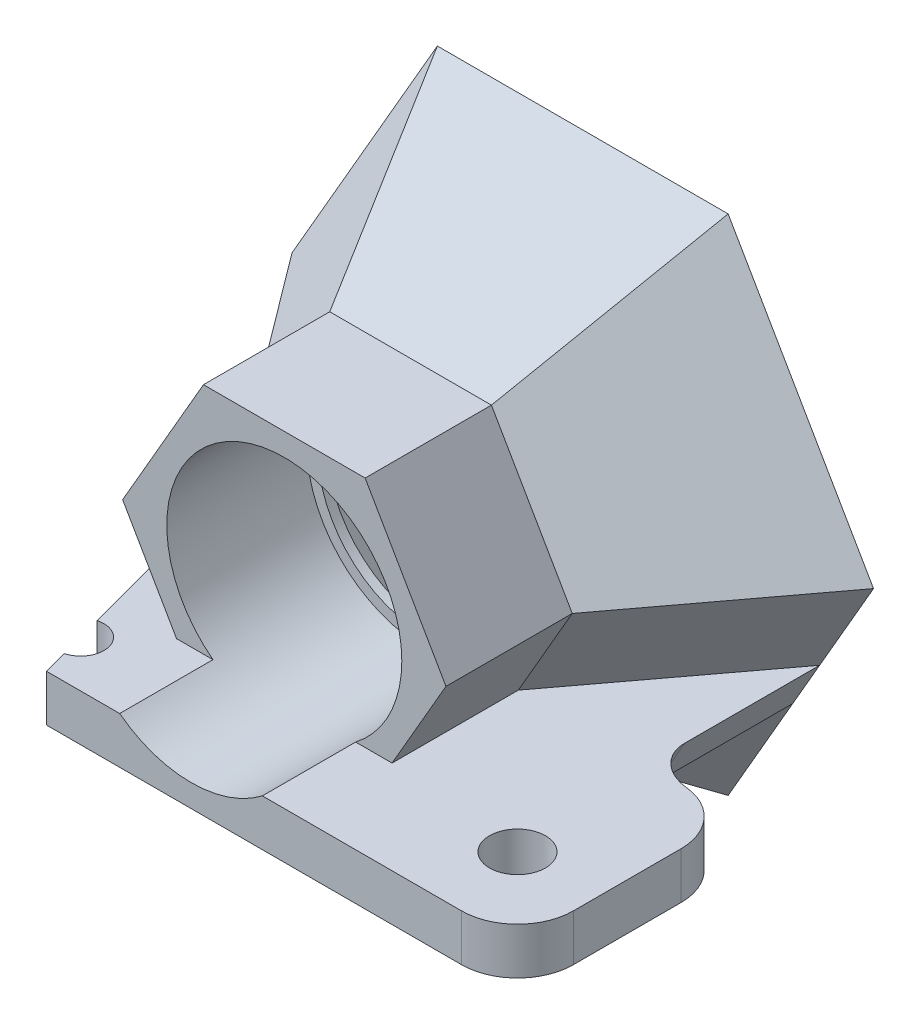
ISO-10303-21;
HEADER;
FILE_DESCRIPTION(('STEP AP214'),'2;1');
FILE_NAME('part.step','',(''),(''),'','','');
FILE_SCHEMA(('AUTOMOTIVE_DESIGN { 1 0 10303 214 1 1 1 1 }'));
ENDSEC;
DATA;
#1=APPLICATION_CONTEXT('core data for automotive mechanical design processes');
#2=APPLICATION_PROTOCOL_DEFINITION('international standard','automotive_design',2000,#1);
#3=PRODUCT_CONTEXT('',#1,'mechanical');
#4=PRODUCT('Part','Part','',(#3));
#5=PRODUCT_RELATED_PRODUCT_CATEGORY('part','',(#4));
#6=PRODUCT_DEFINITION_FORMATION('','',#4);
#7=PRODUCT_DEFINITION_CONTEXT('part definition',#1,'design');
#8=PRODUCT_DEFINITION('design','',#6,#7);
#9=PRODUCT_DEFINITION_SHAPE('','',#8);
#10=(LENGTH_UNIT() NAMED_UNIT(*) SI_UNIT(.MILLI.,.METRE.));
#11=(NAMED_UNIT(*) PLANE_ANGLE_UNIT() SI_UNIT($,.RADIAN.));
#12=(NAMED_UNIT(*) SI_UNIT($,.STERADIAN.) SOLID_ANGLE_UNIT());
#13=UNCERTAINTY_MEASURE_WITH_UNIT(LENGTH_MEASURE(1.E-05),#10,'distance_accuracy_value','');
#14=(GEOMETRIC_REPRESENTATION_CONTEXT(3) GLOBAL_UNCERTAINTY_ASSIGNED_CONTEXT((#13)) GLOBAL_UNIT_ASSIGNED_CONTEXT((#10,
#11,#12)) REPRESENTATION_CONTEXT('',''));
#15=CARTESIAN_POINT('',(0.,0.,0.));
#16=DIRECTION('',(0.,0.,1.));
#17=DIRECTION('',(1.,0.,0.));
#18=AXIS2_PLACEMENT_3D('',#15,#16,#17);
#19=CARTESIAN_POINT('',(-7.75,-15.0059240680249,21.));
#20=DIRECTION('',(0.965925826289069,0.,-0.258819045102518));
#21=DIRECTION('',(-0.258819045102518,0.,-0.965925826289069));
#22=AXIS2_PLACEMENT_3D('',#19,#20,#21);
#23=PLANE('',#22);
#24=DIRECTION('',(0.258819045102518,0.,0.965925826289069));
#25=VECTOR('',#24,1.);
#26=CARTESIAN_POINT('',(-125012.771141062,-7.50592406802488,-466504.090099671));
#27=LINE('',#26,#25);
#28=CARTESIAN_POINT('',(-11.,-7.50592406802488,8.87083487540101));
#29=VERTEX_POINT('',#28);
#30=CARTESIAN_POINT('',(-8.74339678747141,-7.50592406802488,17.2925927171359));
#31=VERTEX_POINT('',#30);
#32=EDGE_CURVE('E304',#29,#31,#27,.T.);
#33=ORIENTED_EDGE('',*,*,#32,.T.);
#34=DIRECTION('',(0.,1.,0.));
#35=VECTOR('',#34,1.);
#36=CARTESIAN_POINT('',(-8.74339678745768,-15.0059240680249,17.2925927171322));
#37=LINE('',#36,#35);
#38=CARTESIAN_POINT('',(-8.74339678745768,-5.00592406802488,17.2925927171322));
#39=VERTEX_POINT('',#38);
#40=EDGE_CURVE('E280',#31,#39,#37,.T.);
#41=ORIENTED_EDGE('',*,*,#40,.T.);
#42=DIRECTION('',(-0.258819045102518,0.,-0.965925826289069));
#43=VECTOR('',#42,1.);
#44=CARTESIAN_POINT('',(-7.75,-5.00592406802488,21.));
#45=LINE('',#44,#43);
#46=CARTESIAN_POINT('',(-11.,-5.00592406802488,8.87083487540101));
#47=VERTEX_POINT('',#46);
#48=EDGE_CURVE('E291',#39,#47,#45,.T.);
#49=ORIENTED_EDGE('',*,*,#48,.T.);
#50=DIRECTION('',(0.,1.,0.));
#51=VECTOR('',#50,1.);
#52=CARTESIAN_POINT('',(-11.,-15.0059240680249,8.87083487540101));
#53=LINE('',#52,#51);
#54=EDGE_CURVE('E297',#29,#47,#53,.T.);
#55=ORIENTED_EDGE('',*,*,#54,.F.);
#56=EDGE_LOOP('',(#33,#41,#49,#55));
#57=FACE_BOUND('',#56,.T.);
#58=ADVANCED_FACE('F47',(#57),#23,.F.);
#59=CARTESIAN_POINT('',(11.2549099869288,-7.50592406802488,-500000.));
#60=DIRECTION('',(0.866025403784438,-0.500000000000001,0.));
#61=DIRECTION('',(0.500000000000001,0.866025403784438,0.));
#62=AXIS2_PLACEMENT_3D('',#59,#60,#61);
#63=PLANE('',#62);
#64=DIRECTION('',(0.,0.,1.));
#65=VECTOR('',#64,1.);
#66=CARTESIAN_POINT('',(12.6982856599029,-5.00592406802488,-500000.));
#67=LINE('',#66,#65);
#68=CARTESIAN_POINT('',(12.6982856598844,-5.00592406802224,1.70530256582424E-10));
#69=VERTEX_POINT('',#68);
#70=CARTESIAN_POINT('',(12.6982856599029,-5.00592406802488,7.23006751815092));
#71=VERTEX_POINT('',#70);
#72=EDGE_CURVE('E432',#69,#71,#67,.T.);
#73=ORIENTED_EDGE('',*,*,#72,.T.);
#74=DIRECTION('',(-0.500000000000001,-0.866025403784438,0.));
#75=VECTOR('',#74,1.);
#76=CARTESIAN_POINT('',(11.2549099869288,-7.50592406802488,7.23006751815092));
#77=LINE('',#76,#75);
#78=CARTESIAN_POINT('',(11.2549099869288,-7.50592406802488,7.23006751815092));
#79=VERTEX_POINT('',#78);
#80=EDGE_CURVE('E607',#71,#79,#77,.T.);
#81=ORIENTED_EDGE('',*,*,#80,.T.);
#82=DIRECTION('',(0.,0.,1.));
#83=VECTOR('',#82,1.);
#84=CARTESIAN_POINT('',(11.2549099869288,-7.50592406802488,-500000.));
#85=LINE('',#84,#83);
#86=CARTESIAN_POINT('',(11.2549099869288,-7.50592406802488,5.6843418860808E-11));
#87=VERTEX_POINT('',#86);
#88=EDGE_CURVE('E435',#87,#79,#85,.T.);
#89=ORIENTED_EDGE('',*,*,#88,.F.);
#90=DIRECTION('',(-0.500000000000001,-0.866025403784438,0.));
#91=VECTOR('',#90,1.);
#92=CARTESIAN_POINT('',(11.2549099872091,-7.50592406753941,5.6843418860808E-11));
#93=LINE('',#92,#91);
#94=EDGE_CURVE('E429',#87,#69,#93,.F.);
#95=ORIENTED_EDGE('',*,*,#94,.T.);
#96=EDGE_LOOP('',(#73,#81,#89,#95));
#97=FACE_BOUND('',#96,.T.);
#98=ADVANCED_FACE('F337',(#97),#63,.T.);
#99=CARTESIAN_POINT('',(-11.2549099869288,-7.50592406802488,-500000.));
#100=DIRECTION('',(-0.866025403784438,-0.500000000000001,0.));
#101=DIRECTION('',(0.500000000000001,-0.866025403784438,0.));
#102=AXIS2_PLACEMENT_3D('',#99,#100,#101);
#103=PLANE('',#102);
#104=DIRECTION('',(0.447213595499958,-0.774596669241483,0.447213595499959));
#105=VECTOR('',#104,1.);
#106=CARTESIAN_POINT('',(-100012.978094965,173200.559476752,-99993.1072600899));
#107=LINE('',#106,#105);
#108=CARTESIAN_POINT('',(-12.6982856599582,-5.00592406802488,7.17254921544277));
#109=VERTEX_POINT('',#108);
#110=CARTESIAN_POINT('',(-11.2549099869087,-7.50592406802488,8.6159248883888));
#111=VERTEX_POINT('',#110);
#112=EDGE_CURVE('E309',#109,#111,#107,.T.);
#113=ORIENTED_EDGE('',*,*,#112,.F.);
#114=DIRECTION('',(0.,0.,1.));
#115=VECTOR('',#114,1.);
#116=CARTESIAN_POINT('',(-12.6982856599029,-5.00592406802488,-500000.));
#117=LINE('',#116,#115);
#118=CARTESIAN_POINT('',(-12.6982856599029,-5.00592406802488,5.6843418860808E-11));
#119=VERTEX_POINT('',#118);
#120=EDGE_CURVE('E414',#119,#109,#117,.T.);
#121=ORIENTED_EDGE('',*,*,#120,.F.);
#122=DIRECTION('',(-0.500000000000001,0.866025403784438,0.));
#123=VECTOR('',#122,1.);
#124=CARTESIAN_POINT('',(-11.2549099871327,-7.50592406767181,5.6843418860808E-11));
#125=LINE('',#124,#123);
#126=CARTESIAN_POINT('',(-11.2549099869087,-7.50592406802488,5.6843418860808E-11));
#127=VERTEX_POINT('',#126);
#128=EDGE_CURVE('E413',#119,#127,#125,.F.);
#129=ORIENTED_EDGE('',*,*,#128,.T.);
#130=DIRECTION('',(0.,0.,1.));
#131=VECTOR('',#130,1.);
#132=CARTESIAN_POINT('',(-11.2549099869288,-7.50592406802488,-500000.));
#133=LINE('',#132,#131);
#134=EDGE_CURVE('E420',#127,#111,#133,.T.);
#135=ORIENTED_EDGE('',*,*,#134,.T.);
#136=EDGE_LOOP('',(#113,#121,#129,#135));
#137=FACE_BOUND('',#136,.T.);
#138=ADVANCED_FACE('F357',(#137),#103,.T.);
#139=CARTESIAN_POINT('',(-15.5884572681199,0.,0.));
#140=DIRECTION('',(-0.72631001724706,-0.419335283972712,0.544639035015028));
#141=DIRECTION('',(0.599934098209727,0.,0.800049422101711));
#142=AXIS2_PLACEMENT_3D('',#139,#140,#141);
#143=PLANE('',#142);
#144=DIRECTION('',(-0.299967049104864,-0.519558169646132,-0.800049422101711));
#145=VECTOR('',#144,1.);
#146=CARTESIAN_POINT('',(-7.79422863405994,-13.5,0.));
#147=LINE('',#146,#145);
#148=CARTESIAN_POINT('',(-4.33354728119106,-7.50592406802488,9.23006751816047));
#149=VERTEX_POINT('',#148);
#150=CARTESIAN_POINT('',(-7.79422863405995,-13.5,0.));
#151=VERTEX_POINT('',#150);
#152=EDGE_CURVE('E565',#149,#151,#147,.T.);
#153=ORIENTED_EDGE('',*,*,#152,.F.);
#154=DIRECTION('',(-0.599934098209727,0.,-0.800049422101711));
#155=VECTOR('',#154,1.);
#156=CARTESIAN_POINT('',(-239997.228052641,-7.50592406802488,-320036.216808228));
#157=LINE('',#156,#155);
#158=EDGE_CURVE('E411',#127,#149,#157,.F.);
#159=ORIENTED_EDGE('',*,*,#158,.F.);
#160=DIRECTION('',(0.5,-0.866025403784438,0.));
#161=VECTOR('',#160,1.);
#162=CARTESIAN_POINT('',(-15.5884572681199,0.,0.));
#163=LINE('',#162,#161);
#164=EDGE_CURVE('E545',#127,#151,#163,.T.);
#165=ORIENTED_EDGE('',*,*,#164,.T.);
#166=EDGE_LOOP('',(#153,#159,#165));
#167=FACE_BOUND('',#166,.T.);
#168=ADVANCED_FACE('F360',(#167),#143,.T.);
#169=CARTESIAN_POINT('',(7.79422863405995,-13.5,0.));
#170=DIRECTION('',(0.72631001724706,-0.419335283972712,0.544639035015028));
#171=DIRECTION('',(0.599934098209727,0.,-0.800049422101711));
#172=AXIS2_PLACEMENT_3D('',#169,#170,#171);
#173=PLANE('',#172);
#174=DIRECTION('',(-0.5,-0.866025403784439,0.));
#175=VECTOR('',#174,1.);
#176=CARTESIAN_POINT('',(4.33354728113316,-7.50592406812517,9.23006751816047));
#177=LINE('',#176,#175);
#178=CARTESIAN_POINT('',(5.77692295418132,-5.00592406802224,9.23006751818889));
#179=VERTEX_POINT('',#178);
#180=CARTESIAN_POINT('',(8.66709456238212,0.,9.23006751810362));
#181=VERTEX_POINT('',#180);
#182=EDGE_CURVE('E474',#179,#181,#177,.F.);
#183=ORIENTED_EDGE('',*,*,#182,.F.);
#184=DIRECTION('',(0.599934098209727,0.,-0.800049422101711));
#185=VECTOR('',#184,1.);
#186=CARTESIAN_POINT('',(240001.162571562,-5.0059240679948,-320039.538902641));
#187=LINE('',#186,#185);
#188=EDGE_CURVE('E438',#69,#179,#187,.F.);
#189=ORIENTED_EDGE('',*,*,#188,.F.);
#190=DIRECTION('',(0.5,0.866025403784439,0.));
#191=VECTOR('',#190,1.);
#192=CARTESIAN_POINT('',(7.79422863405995,-13.5,0.));
#193=LINE('',#192,#191);
#194=CARTESIAN_POINT('',(15.5884572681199,0.,0.));
#195=VERTEX_POINT('',#194);
#196=EDGE_CURVE('E552',#69,#195,#193,.T.);
#197=ORIENTED_EDGE('',*,*,#196,.T.);
#198=DIRECTION('',(0.599934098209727,0.,-0.800049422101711));
#199=VECTOR('',#198,1.);
#200=CARTESIAN_POINT('',(15.5884572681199,0.,0.));
#201=LINE('',#200,#199);
#202=EDGE_CURVE('E556',#181,#195,#201,.T.);
#203=ORIENTED_EDGE('',*,*,#202,.F.);
#204=EDGE_LOOP('',(#183,#189,#197,#203));
#205=FACE_BOUND('',#204,.T.);
#206=ADVANCED_FACE('F795',(#205),#173,.T.);
#207=CARTESIAN_POINT('',(15.5884572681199,0.,0.));
#208=DIRECTION('',(0.72631001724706,0.419335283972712,0.544639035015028));
#209=DIRECTION('',(0.599934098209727,0.,-0.800049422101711));
#210=AXIS2_PLACEMENT_3D('',#207,#208,#209);
#211=PLANE('',#210);
#212=DIRECTION('',(0.299967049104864,0.519558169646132,-0.800049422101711));
#213=VECTOR('',#212,1.);
#214=CARTESIAN_POINT('',(7.79422863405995,13.5,0.));
#215=LINE('',#214,#213);
#216=CARTESIAN_POINT('',(4.33354728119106,7.50592406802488,9.23006751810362));
#217=VERTEX_POINT('',#216);
#218=CARTESIAN_POINT('',(7.79422863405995,13.5,0.));
#219=VERTEX_POINT('',#218);
#220=EDGE_CURVE('E557',#217,#219,#215,.T.);
#221=ORIENTED_EDGE('',*,*,#220,.F.);
#222=DIRECTION('',(0.5,-0.866025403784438,0.));
#223=VECTOR('',#222,1.);
#224=CARTESIAN_POINT('',(8.66709456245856,-1.32398094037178E-10,9.23006751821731));
#225=LINE('',#224,#223);
#226=EDGE_CURVE('E477',#181,#217,#225,.F.);
#227=ORIENTED_EDGE('',*,*,#226,.F.);
#228=ORIENTED_EDGE('',*,*,#202,.T.);
#229=DIRECTION('',(-0.5,0.866025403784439,0.));
#230=VECTOR('',#229,1.);
#231=CARTESIAN_POINT('',(15.5884572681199,0.,0.));
#232=LINE('',#231,#230);
#233=EDGE_CURVE('E509',#195,#219,#232,.T.);
#234=ORIENTED_EDGE('',*,*,#233,.T.);
#235=EDGE_LOOP('',(#221,#227,#228,#234));
#236=FACE_BOUND('',#235,.T.);
#237=ADVANCED_FACE('F818',(#236),#211,.T.);
#238=CARTESIAN_POINT('',(7.79422863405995,13.5,0.));
#239=DIRECTION('',(0.,0.838670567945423,0.544639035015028));
#240=DIRECTION('',(0.,-0.544639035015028,0.838670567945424));
#241=AXIS2_PLACEMENT_3D('',#238,#239,#240);
#242=PLANE('',#241);
#243=DIRECTION('',(-0.299967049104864,0.519558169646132,-0.800049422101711));
#244=VECTOR('',#243,1.);
#245=CARTESIAN_POINT('',(-7.79422863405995,13.5,0.));
#246=LINE('',#245,#244);
#247=CARTESIAN_POINT('',(-4.33354728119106,7.50592406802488,9.23006751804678));
#248=VERTEX_POINT('',#247);
#249=CARTESIAN_POINT('',(-7.79422863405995,13.5,0.));
#250=VERTEX_POINT('',#249);
#251=EDGE_CURVE('E560',#248,#250,#246,.T.);
#252=ORIENTED_EDGE('',*,*,#251,.F.);
#253=DIRECTION('',(1.,0.,0.));
#254=VECTOR('',#253,1.);
#255=CARTESIAN_POINT('',(4.33354728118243,7.50592406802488,9.23006751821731));
#256=LINE('',#255,#254);
#257=EDGE_CURVE('E487',#217,#248,#256,.F.);
#258=ORIENTED_EDGE('',*,*,#257,.F.);
#259=ORIENTED_EDGE('',*,*,#220,.T.);
#260=DIRECTION('',(-1.,0.,0.));
#261=VECTOR('',#260,1.);
#262=CARTESIAN_POINT('',(7.79422863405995,13.5,0.));
#263=LINE('',#262,#261);
#264=EDGE_CURVE('E539',#219,#250,#263,.T.);
#265=ORIENTED_EDGE('',*,*,#264,.T.);
#266=EDGE_LOOP('',(#252,#258,#259,#265));
#267=FACE_BOUND('',#266,.T.);
#268=ADVANCED_FACE('F49',(#267),#242,.T.);
#269=CARTESIAN_POINT('',(-7.79422863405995,13.5,0.));
#270=DIRECTION('',(-0.72631001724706,0.419335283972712,0.544639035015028));
#271=DIRECTION('',(0.599934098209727,0.,0.800049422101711));
#272=AXIS2_PLACEMENT_3D('',#269,#270,#271);
#273=PLANE('',#272);
#274=DIRECTION('',(-0.599934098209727,0.,-0.800049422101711));
#275=VECTOR('',#274,1.);
#276=CARTESIAN_POINT('',(-15.5884572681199,0.,0.));
#277=LINE('',#276,#275);
#278=CARTESIAN_POINT('',(-8.66709456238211,0.,9.23006751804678));
#279=VERTEX_POINT('',#278);
#280=CARTESIAN_POINT('',(-15.5884572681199,0.,0.));
#281=VERTEX_POINT('',#280);
#282=EDGE_CURVE('E568',#279,#281,#277,.T.);
#283=ORIENTED_EDGE('',*,*,#282,.F.);
#284=DIRECTION('',(0.5,0.866025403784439,0.));
#285=VECTOR('',#284,1.);
#286=CARTESIAN_POINT('',(-4.33354728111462,7.50592406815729,9.23006751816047));
#287=LINE('',#286,#285);
#288=EDGE_CURVE('E485',#248,#279,#287,.F.);
#289=ORIENTED_EDGE('',*,*,#288,.F.);
#290=ORIENTED_EDGE('',*,*,#251,.T.);
#291=DIRECTION('',(-0.5,-0.866025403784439,0.));
#292=VECTOR('',#291,1.);
#293=CARTESIAN_POINT('',(-7.79422863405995,13.5,0.));
#294=LINE('',#293,#292);
#295=EDGE_CURVE('E542',#250,#281,#294,.T.);
#296=ORIENTED_EDGE('',*,*,#295,.T.);
#297=EDGE_LOOP('',(#283,#289,#290,#296));
#298=FACE_BOUND('',#297,.T.);
#299=ADVANCED_FACE('F809',(#298),#273,.T.);
#300=EDGE_CURVE('E546',#281,#119,#163,.T.);
#301=ORIENTED_EDGE('',*,*,#300,.T.);
#302=DIRECTION('',(0.599934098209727,0.,0.800049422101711));
#303=VECTOR('',#302,1.);
#304=CARTESIAN_POINT('',(-240001.162571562,-5.0059240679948,-320039.538902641));
#305=LINE('',#304,#303);
#306=CARTESIAN_POINT('',(-5.77692295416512,-5.00592406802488,9.23006751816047));
#307=VERTEX_POINT('',#306);
#308=EDGE_CURVE('E415',#307,#119,#305,.F.);
#309=ORIENTED_EDGE('',*,*,#308,.F.);
#310=DIRECTION('',(-0.5,0.866025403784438,0.));
#311=VECTOR('',#310,1.);
#312=CARTESIAN_POINT('',(-8.66709456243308,8.82728235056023E-11,9.23006751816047));
#313=LINE('',#312,#311);
#314=EDGE_CURVE('E481',#279,#307,#313,.F.);
#315=ORIENTED_EDGE('',*,*,#314,.F.);
#316=ORIENTED_EDGE('',*,*,#282,.T.);
#317=EDGE_LOOP('',(#301,#309,#315,#316));
#318=FACE_BOUND('',#317,.T.);
#319=ADVANCED_FACE('F801',(#318),#143,.T.);
#320=CARTESIAN_POINT('',(-7.79422863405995,-13.5,0.));
#321=DIRECTION('',(0.,-0.838670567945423,0.544639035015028));
#322=DIRECTION('',(0.,-0.544639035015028,-0.838670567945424));
#323=AXIS2_PLACEMENT_3D('',#320,#321,#322);
#324=PLANE('',#323);
#325=DIRECTION('',(0.299967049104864,-0.519558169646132,-0.800049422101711));
#326=VECTOR('',#325,1.);
#327=CARTESIAN_POINT('',(7.79422863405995,-13.5,0.));
#328=LINE('',#327,#326);
#329=CARTESIAN_POINT('',(4.33354728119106,-7.50592406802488,9.23006751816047));
#330=VERTEX_POINT('',#329);
#331=CARTESIAN_POINT('',(7.79422863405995,-13.5,0.));
#332=VERTEX_POINT('',#331);
#333=EDGE_CURVE('E563',#330,#332,#328,.T.);
#334=ORIENTED_EDGE('',*,*,#333,.F.);
#335=DIRECTION('',(-1.,0.,0.));
#336=VECTOR('',#335,1.);
#337=CARTESIAN_POINT('',(-4.33354728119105,-7.50592406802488,9.23006751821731));
#338=LINE('',#337,#336);
#339=EDGE_CURVE('E478',#149,#330,#338,.F.);
#340=ORIENTED_EDGE('',*,*,#339,.F.);
#341=ORIENTED_EDGE('',*,*,#152,.T.);
#342=DIRECTION('',(1.,0.,0.));
#343=VECTOR('',#342,1.);
#344=CARTESIAN_POINT('',(-7.79422863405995,-13.5,0.));
#345=LINE('',#344,#343);
#346=EDGE_CURVE('E549',#151,#332,#345,.T.);
#347=ORIENTED_EDGE('',*,*,#346,.T.);
#348=EDGE_LOOP('',(#334,#340,#341,#347));
#349=FACE_BOUND('',#348,.T.);
#350=ADVANCED_FACE('F792',(#349),#324,.T.);
#351=EDGE_CURVE('E553',#332,#87,#193,.T.);
#352=ORIENTED_EDGE('',*,*,#351,.T.);
#353=DIRECTION('',(-0.599934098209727,0.,0.800049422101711));
#354=VECTOR('',#353,1.);
#355=CARTESIAN_POINT('',(239997.228052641,-7.50592406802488,-320036.216808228));
#356=LINE('',#355,#354);
#357=EDGE_CURVE('E426',#330,#87,#356,.F.);
#358=ORIENTED_EDGE('',*,*,#357,.F.);
#359=ORIENTED_EDGE('',*,*,#333,.T.);
#360=EDGE_LOOP('',(#352,#358,#359));
#361=FACE_BOUND('',#360,.T.);
#362=ADVANCED_FACE('F783',(#361),#173,.T.);
#363=CARTESIAN_POINT('',(0.,27.,0.));
#364=DIRECTION('',(0.,0.,1.));
#365=DIRECTION('',(1.,0.,0.));
#366=AXIS2_PLACEMENT_3D('',#363,#364,#365);
#367=PLANE('',#366);
#368=DIRECTION('',(-1.,0.,0.));
#369=VECTOR('',#368,1.);
#370=CARTESIAN_POINT('',(6.41740609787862,-12.4726626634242,0.));
#371=LINE('',#370,#369);
#372=CARTESIAN_POINT('',(-7.20109514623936,-12.4726626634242,0.));
#373=VERTEX_POINT('',#372);
#374=CARTESIAN_POINT('',(7.20109514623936,-12.4726626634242,0.));
#375=VERTEX_POINT('',#374);
#376=EDGE_CURVE('E578',#373,#375,#371,.F.);
#377=ORIENTED_EDGE('',*,*,#376,.T.);
#378=DIRECTION('',(-0.5,-0.866025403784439,0.));
#379=VECTOR('',#378,1.);
#380=CARTESIAN_POINT('',(14.0103457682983,-0.678694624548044,0.));
#381=LINE('',#380,#379);
#382=CARTESIAN_POINT('',(14.4021902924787,0.,0.));
#383=VERTEX_POINT('',#382);
#384=EDGE_CURVE('E580',#375,#383,#381,.F.);
#385=ORIENTED_EDGE('',*,*,#384,.T.);
#386=DIRECTION('',(0.5,-0.866025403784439,0.));
#387=VECTOR('',#386,1.);
#388=CARTESIAN_POINT('',(7.59293967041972,11.7939680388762,0.));
#389=LINE('',#388,#387);
#390=CARTESIAN_POINT('',(7.20109514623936,12.4726626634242,0.));
#391=VERTEX_POINT('',#390);
#392=EDGE_CURVE('E559',#383,#391,#389,.F.);
#393=ORIENTED_EDGE('',*,*,#392,.T.);
#394=DIRECTION('',(1.,0.,0.));
#395=VECTOR('',#394,1.);
#396=CARTESIAN_POINT('',(-6.41740609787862,12.4726626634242,0.));
#397=LINE('',#396,#395);
#398=CARTESIAN_POINT('',(-7.20109514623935,12.4726626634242,0.));
#399=VERTEX_POINT('',#398);
#400=EDGE_CURVE('E572',#391,#399,#397,.F.);
#401=ORIENTED_EDGE('',*,*,#400,.T.);
#402=DIRECTION('',(0.5,0.866025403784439,0.));
#403=VECTOR('',#402,1.);
#404=CARTESIAN_POINT('',(-14.0103457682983,0.678694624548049,0.));
#405=LINE('',#404,#403);
#406=CARTESIAN_POINT('',(-14.4021902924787,0.,0.));
#407=VERTEX_POINT('',#406);
#408=EDGE_CURVE('E574',#399,#407,#405,.F.);
#409=ORIENTED_EDGE('',*,*,#408,.T.);
#410=DIRECTION('',(-0.5,0.866025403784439,0.));
#411=VECTOR('',#410,1.);
#412=CARTESIAN_POINT('',(-7.59293967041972,-11.7939680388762,0.));
#413=LINE('',#412,#411);
#414=EDGE_CURVE('E576',#407,#373,#413,.F.);
#415=ORIENTED_EDGE('',*,*,#414,.T.);
#416=EDGE_LOOP('',(#377,#385,#393,#401,#409,#415));
#417=FACE_BOUND('',#416,.T.);
#418=ORIENTED_EDGE('',*,*,#233,.F.);
#419=ORIENTED_EDGE('',*,*,#196,.F.);
#420=ORIENTED_EDGE('',*,*,#94,.F.);
#421=ORIENTED_EDGE('',*,*,#351,.F.);
#422=ORIENTED_EDGE('',*,*,#346,.F.);
#423=ORIENTED_EDGE('',*,*,#164,.F.);
#424=ORIENTED_EDGE('',*,*,#128,.F.);
#425=ORIENTED_EDGE('',*,*,#300,.F.);
#426=ORIENTED_EDGE('',*,*,#295,.F.);
#427=ORIENTED_EDGE('',*,*,#264,.F.);
#428=EDGE_LOOP('',(#418,#419,#420,#421,#422,#423,#424,#425,#426,#427));
#429=FACE_BOUND('',#428,.T.);
#430=ADVANCED_FACE('F778',(#417,#429),#367,.F.);
#431=CARTESIAN_POINT('',(14.1358372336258,-0.838670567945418,-1.08927807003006));
#432=DIRECTION('',(0.72631001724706,0.419335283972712,0.544639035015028));
#433=DIRECTION('',(0.599934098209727,0.,-0.800049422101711));
#434=AXIS2_PLACEMENT_3D('',#431,#432,#433);
#435=PLANE('',#434);
#436=DIRECTION('',(0.299967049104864,0.519558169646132,-0.800049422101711));
#437=VECTOR('',#436,1.);
#438=CARTESIAN_POINT('',(6.91295333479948,11.9735864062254,-1.32168610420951));
#439=LINE('',#438,#437);
#440=CARTESIAN_POINT('',(3.41792090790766,5.92001266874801,8.));
#441=VERTEX_POINT('',#440);
#442=CARTESIAN_POINT('',(5.99057845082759,10.3759862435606,1.13840241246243));
#443=VERTEX_POINT('',#442);
#444=EDGE_CURVE('E506',#441,#443,#439,.T.);
#445=ORIENTED_EDGE('',*,*,#444,.T.);
#446=DIRECTION('',(-0.5,0.866025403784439,0.));
#447=VECTOR('',#446,1.);
#448=CARTESIAN_POINT('',(12.1945707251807,-0.369643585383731,1.13840241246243));
#449=LINE('',#448,#447);
#450=CARTESIAN_POINT('',(11.9811569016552,0.,1.13840241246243));
#451=VERTEX_POINT('',#450);
#452=EDGE_CURVE('E594',#443,#451,#449,.F.);
#453=ORIENTED_EDGE('',*,*,#452,.T.);
#454=DIRECTION('',(0.599934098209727,0.,-0.800049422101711));
#455=VECTOR('',#454,1.);
#456=CARTESIAN_POINT('',(13.825906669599,0.,-1.32168610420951));
#457=LINE('',#456,#455);
#458=CARTESIAN_POINT('',(6.83584181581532,0.,8.));
#459=VERTEX_POINT('',#458);
#460=EDGE_CURVE('E514',#459,#451,#457,.T.);
#461=ORIENTED_EDGE('',*,*,#460,.F.);
#462=DIRECTION('',(0.5,-0.866025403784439,0.));
#463=VECTOR('',#462,1.);
#464=CARTESIAN_POINT('',(9.02399567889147,-3.78999366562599,8.));
#465=LINE('',#464,#463);
#466=EDGE_CURVE('E505',#459,#441,#465,.F.);
#467=ORIENTED_EDGE('',*,*,#466,.T.);
#468=EDGE_LOOP('',(#445,#453,#461,#467));
#469=FACE_BOUND('',#468,.T.);
#470=ADVANCED_FACE('F782',(#469),#435,.F.);
#471=CARTESIAN_POINT('',(7.79422863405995,11.8226588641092,-1.08927807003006));
#472=DIRECTION('',(0.,0.838670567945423,0.544639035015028));
#473=DIRECTION('',(0.,-0.544639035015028,0.838670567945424));
#474=AXIS2_PLACEMENT_3D('',#471,#472,#473);
#475=PLANE('',#474);
#476=DIRECTION('',(-0.299967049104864,0.519558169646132,-0.800049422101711));
#477=VECTOR('',#476,1.);
#478=CARTESIAN_POINT('',(-6.91295333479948,11.9735864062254,-1.32168610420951));
#479=LINE('',#478,#477);
#480=CARTESIAN_POINT('',(-3.41792090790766,5.92001266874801,8.));
#481=VERTEX_POINT('',#480);
#482=CARTESIAN_POINT('',(-5.99057845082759,10.3759862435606,1.13840241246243));
#483=VERTEX_POINT('',#482);
#484=EDGE_CURVE('E510',#481,#483,#479,.T.);
#485=ORIENTED_EDGE('',*,*,#484,.T.);
#486=DIRECTION('',(-1.,0.,0.));
#487=VECTOR('',#486,1.);
#488=CARTESIAN_POINT('',(6.41740609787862,10.3759862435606,1.13840241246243));
#489=LINE('',#488,#487);
#490=EDGE_CURVE('E592',#483,#443,#489,.F.);
#491=ORIENTED_EDGE('',*,*,#490,.T.);
#492=ORIENTED_EDGE('',*,*,#444,.F.);
#493=DIRECTION('',(1.,0.,0.));
#494=VECTOR('',#493,1.);
#495=CARTESIAN_POINT('',(7.79422863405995,5.92001266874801,8.));
#496=LINE('',#495,#494);
#497=EDGE_CURVE('E513',#441,#481,#496,.F.);
#498=ORIENTED_EDGE('',*,*,#497,.T.);
#499=EDGE_LOOP('',(#485,#491,#492,#498));
#500=FACE_BOUND('',#499,.T.);
#501=ADVANCED_FACE('F903',(#500),#475,.F.);
#502=CARTESIAN_POINT('',(-6.34160859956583,12.6613294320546,-1.08927807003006));
#503=DIRECTION('',(-0.72631001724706,0.419335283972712,0.544639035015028));
#504=DIRECTION('',(0.599934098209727,0.,0.800049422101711));
#505=AXIS2_PLACEMENT_3D('',#502,#503,#504);
#506=PLANE('',#505);
#507=DIRECTION('',(-0.599934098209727,0.,-0.800049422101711));
#508=VECTOR('',#507,1.);
#509=CARTESIAN_POINT('',(-13.825906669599,0.,-1.32168610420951));
#510=LINE('',#509,#508);
#511=CARTESIAN_POINT('',(-6.83584181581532,0.,8.));
#512=VERTEX_POINT('',#511);
#513=CARTESIAN_POINT('',(-11.9811569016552,0.,1.13840241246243));
#514=VERTEX_POINT('',#513);
#515=EDGE_CURVE('E521',#512,#514,#510,.T.);
#516=ORIENTED_EDGE('',*,*,#515,.T.);
#517=DIRECTION('',(-0.5,-0.866025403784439,0.));
#518=VECTOR('',#517,1.);
#519=CARTESIAN_POINT('',(-5.77716462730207,10.7456298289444,1.13840241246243));
#520=LINE('',#519,#518);
#521=EDGE_CURVE('E590',#514,#483,#520,.F.);
#522=ORIENTED_EDGE('',*,*,#521,.T.);
#523=ORIENTED_EDGE('',*,*,#484,.F.);
#524=DIRECTION('',(0.5,0.866025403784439,0.));
#525=VECTOR('',#524,1.);
#526=CARTESIAN_POINT('',(-1.22976704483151,9.71000633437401,8.));
#527=LINE('',#526,#525);
#528=EDGE_CURVE('E523',#481,#512,#527,.F.);
#529=ORIENTED_EDGE('',*,*,#528,.T.);
#530=EDGE_LOOP('',(#516,#522,#523,#529));
#531=FACE_BOUND('',#530,.T.);
#532=ADVANCED_FACE('F895',(#531),#506,.F.);
#533=CARTESIAN_POINT('',(-14.1358372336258,0.838670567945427,-1.08927807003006));
#534=DIRECTION('',(-0.72631001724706,-0.419335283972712,0.544639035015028));
#535=DIRECTION('',(0.599934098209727,0.,0.800049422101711));
#536=AXIS2_PLACEMENT_3D('',#533,#534,#535);
#537=PLANE('',#536);
#538=DIRECTION('',(-0.299967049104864,-0.519558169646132,-0.800049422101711));
#539=VECTOR('',#538,1.);
#540=CARTESIAN_POINT('',(-6.91295333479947,-11.9735864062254,-1.32168610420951));
#541=LINE('',#540,#539);
#542=CARTESIAN_POINT('',(-3.41792090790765,-5.92001266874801,8.));
#543=VERTEX_POINT('',#542);
#544=CARTESIAN_POINT('',(-5.99057845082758,-10.3759862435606,1.13840241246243));
#545=VERTEX_POINT('',#544);
#546=EDGE_CURVE('E526',#543,#545,#541,.T.);
#547=ORIENTED_EDGE('',*,*,#546,.T.);
#548=DIRECTION('',(0.5,-0.866025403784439,0.));
#549=VECTOR('',#548,1.);
#550=CARTESIAN_POINT('',(-12.1945707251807,0.369643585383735,1.13840241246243));
#551=LINE('',#550,#549);
#552=EDGE_CURVE('E588',#545,#514,#551,.F.);
#553=ORIENTED_EDGE('',*,*,#552,.T.);
#554=ORIENTED_EDGE('',*,*,#515,.F.);
#555=DIRECTION('',(-0.5,0.866025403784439,0.));
#556=VECTOR('',#555,1.);
#557=CARTESIAN_POINT('',(-9.02399567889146,3.789993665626,8.));
#558=LINE('',#557,#556);
#559=EDGE_CURVE('E528',#512,#543,#558,.F.);
#560=ORIENTED_EDGE('',*,*,#559,.T.);
#561=EDGE_LOOP('',(#547,#553,#554,#560));
#562=FACE_BOUND('',#561,.T.);
#563=ADVANCED_FACE('F887',(#562),#537,.F.);
#564=CARTESIAN_POINT('',(-7.79422863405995,-11.8226588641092,-1.08927807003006));
#565=DIRECTION('',(0.,-0.838670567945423,0.544639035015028));
#566=DIRECTION('',(0.,-0.544639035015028,-0.838670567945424));
#567=AXIS2_PLACEMENT_3D('',#564,#565,#566);
#568=PLANE('',#567);
#569=DIRECTION('',(0.299967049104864,-0.519558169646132,-0.800049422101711));
#570=VECTOR('',#569,1.);
#571=CARTESIAN_POINT('',(6.91295333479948,-11.9735864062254,-1.32168610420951));
#572=LINE('',#571,#570);
#573=CARTESIAN_POINT('',(3.41792090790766,-5.92001266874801,8.));
#574=VERTEX_POINT('',#573);
#575=CARTESIAN_POINT('',(5.99057845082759,-10.3759862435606,1.13840241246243));
#576=VERTEX_POINT('',#575);
#577=EDGE_CURVE('E517',#574,#576,#572,.T.);
#578=ORIENTED_EDGE('',*,*,#577,.T.);
#579=DIRECTION('',(1.,0.,0.));
#580=VECTOR('',#579,1.);
#581=CARTESIAN_POINT('',(-6.41740609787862,-10.3759862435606,1.13840241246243));
#582=LINE('',#581,#580);
#583=EDGE_CURVE('E586',#576,#545,#582,.F.);
#584=ORIENTED_EDGE('',*,*,#583,.T.);
#585=ORIENTED_EDGE('',*,*,#546,.F.);
#586=DIRECTION('',(-1.,0.,0.));
#587=VECTOR('',#586,1.);
#588=CARTESIAN_POINT('',(-7.79422863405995,-5.92001266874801,8.));
#589=LINE('',#588,#587);
#590=EDGE_CURVE('E532',#543,#574,#589,.F.);
#591=ORIENTED_EDGE('',*,*,#590,.T.);
#592=EDGE_LOOP('',(#578,#584,#585,#591));
#593=FACE_BOUND('',#592,.T.);
#594=ADVANCED_FACE('F878',(#593),#568,.F.);
#595=CARTESIAN_POINT('',(6.34160859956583,-12.6613294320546,-1.08927807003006));
#596=DIRECTION('',(0.72631001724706,-0.419335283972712,0.544639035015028));
#597=DIRECTION('',(0.599934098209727,0.,-0.800049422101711));
#598=AXIS2_PLACEMENT_3D('',#595,#596,#597);
#599=PLANE('',#598);
#600=ORIENTED_EDGE('',*,*,#460,.T.);
#601=DIRECTION('',(0.5,0.866025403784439,0.));
#602=VECTOR('',#601,1.);
#603=CARTESIAN_POINT('',(5.77716462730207,-10.7456298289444,1.13840241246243));
#604=LINE('',#603,#602);
#605=EDGE_CURVE('E583',#451,#576,#604,.F.);
#606=ORIENTED_EDGE('',*,*,#605,.T.);
#607=ORIENTED_EDGE('',*,*,#577,.F.);
#608=DIRECTION('',(-0.5,-0.866025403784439,0.));
#609=VECTOR('',#608,1.);
#610=CARTESIAN_POINT('',(1.22976704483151,-9.710006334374,8.));
#611=LINE('',#610,#609);
#612=EDGE_CURVE('E518',#574,#459,#611,.F.);
#613=ORIENTED_EDGE('',*,*,#612,.T.);
#614=EDGE_LOOP('',(#600,#606,#607,#613));
#615=FACE_BOUND('',#614,.T.);
#616=ADVANCED_FACE('F874',(#615),#599,.F.);
#617=CARTESIAN_POINT('',(0.,27.,8.));
#618=DIRECTION('',(0.,0.,1.));
#619=DIRECTION('',(1.,0.,0.));
#620=AXIS2_PLACEMENT_3D('',#617,#618,#619);
#621=PLANE('',#620);
#622=CARTESIAN_POINT('',(0.,0.,8.));
#623=DIRECTION('',(0.,0.,1.));
#624=DIRECTION('',(1.,0.,0.));
#625=AXIS2_PLACEMENT_3D('',#622,#623,#624);
#626=CIRCLE('',#625,5.7);
#627=CARTESIAN_POINT('',(5.7,0.,8.));
#628=VERTEX_POINT('',#627);
#629=EDGE_CURVE('E499',#628,#628,#626,.T.);
#630=ORIENTED_EDGE('',*,*,#629,.T.);
#631=EDGE_LOOP('',(#630));
#632=FACE_BOUND('',#631,.T.);
#633=ORIENTED_EDGE('',*,*,#466,.F.);
#634=ORIENTED_EDGE('',*,*,#612,.F.);
#635=ORIENTED_EDGE('',*,*,#590,.F.);
#636=ORIENTED_EDGE('',*,*,#559,.F.);
#637=ORIENTED_EDGE('',*,*,#528,.F.);
#638=ORIENTED_EDGE('',*,*,#497,.F.);
#639=EDGE_LOOP('',(#633,#634,#635,#636,#637,#638));
#640=FACE_BOUND('',#639,.T.);
#641=ADVANCED_FACE('F645',(#632,#640),#621,.F.);
#642=CARTESIAN_POINT('',(0.,0.,8.5));
#643=DIRECTION('',(0.,0.,1.));
#644=DIRECTION('',(1.,0.,0.));
#645=AXIS2_PLACEMENT_3D('',#642,#643,#644);
#646=CYLINDRICAL_SURFACE('',#645,6.3);
#647=DIRECTION('',(0.,0.,1.));
#648=VECTOR('',#647,1.);
#649=CARTESIAN_POINT('',(3.82501297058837,-5.00592406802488,9.23006751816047));
#650=LINE('',#649,#648);
#651=CARTESIAN_POINT('',(3.82501297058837,-5.00592406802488,16.));
#652=VERTEX_POINT('',#651);
#653=CARTESIAN_POINT('',(3.82501297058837,-5.00592406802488,21.));
#654=VERTEX_POINT('',#653);
#655=EDGE_CURVE('E390',#652,#654,#650,.T.);
#656=ORIENTED_EDGE('',*,*,#655,.F.);
#657=CARTESIAN_POINT('',(0.,0.,16.));
#658=DIRECTION('',(0.,0.,1.));
#659=DIRECTION('',(1.,0.,0.));
#660=AXIS2_PLACEMENT_3D('',#657,#658,#659);
#661=CIRCLE('',#660,6.3);
#662=CARTESIAN_POINT('',(-3.82501297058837,-5.00592406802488,16.));
#663=VERTEX_POINT('',#662);
#664=EDGE_CURVE('E456',#652,#663,#661,.T.);
#665=ORIENTED_EDGE('',*,*,#664,.T.);
#666=DIRECTION('',(0.,0.,1.));
#667=VECTOR('',#666,1.);
#668=CARTESIAN_POINT('',(-3.82501297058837,-5.00592406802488,9.23006751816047));
#669=LINE('',#668,#667);
#670=CARTESIAN_POINT('',(-3.82501297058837,-5.00592406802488,21.));
#671=VERTEX_POINT('',#670);
#672=EDGE_CURVE('E403',#663,#671,#669,.T.);
#673=ORIENTED_EDGE('',*,*,#672,.T.);
#674=CARTESIAN_POINT('',(0.,0.,21.));
#675=DIRECTION('',(0.,0.,-1.));
#676=DIRECTION('',(1.,0.,0.));
#677=AXIS2_PLACEMENT_3D('',#674,#675,#676);
#678=CIRCLE('',#677,6.30000000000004);
#679=EDGE_CURVE('E392',#654,#671,#678,.T.);
#680=ORIENTED_EDGE('',*,*,#679,.F.);
#681=EDGE_LOOP('',(#656,#665,#673,#680));
#682=FACE_BOUND('',#681,.T.);
#683=CARTESIAN_POINT('',(0.,0.,8.5));
#684=DIRECTION('',(0.,0.,1.));
#685=DIRECTION('',(1.,0.,0.));
#686=AXIS2_PLACEMENT_3D('',#683,#684,#685);
#687=CIRCLE('',#686,6.3);
#688=CARTESIAN_POINT('',(6.3,0.,8.5));
#689=VERTEX_POINT('',#688);
#690=EDGE_CURVE('E502',#689,#689,#687,.T.);
#691=ORIENTED_EDGE('',*,*,#690,.F.);
#692=EDGE_LOOP('',(#691));
#693=FACE_BOUND('',#692,.T.);
#694=ADVANCED_FACE('F641',(#682,#693),#646,.F.);
#695=CARTESIAN_POINT('',(0.,0.,8.5));
#696=DIRECTION('',(0.,0.,1.));
#697=DIRECTION('',(1.,0.,0.));
#698=AXIS2_PLACEMENT_3D('',#695,#696,#697);
#699=PLANE('',#698);
#700=CARTESIAN_POINT('',(0.,0.,8.5));
#701=DIRECTION('',(0.,0.,1.));
#702=DIRECTION('',(1.,0.,0.));
#703=AXIS2_PLACEMENT_3D('',#700,#701,#702);
#704=CIRCLE('',#703,5.7);
#705=CARTESIAN_POINT('',(5.7,0.,8.5));
#706=VERTEX_POINT('',#705);
#707=EDGE_CURVE('E476',#706,#706,#704,.T.);
#708=ORIENTED_EDGE('',*,*,#707,.F.);
#709=EDGE_LOOP('',(#708));
#710=FACE_BOUND('',#709,.T.);
#711=ORIENTED_EDGE('',*,*,#690,.T.);
#712=EDGE_LOOP('',(#711));
#713=FACE_BOUND('',#712,.T.);
#714=ADVANCED_FACE('F644',(#710,#713),#699,.T.);
#715=CARTESIAN_POINT('',(0.,0.,0.));
#716=DIRECTION('',(0.,0.,1.));
#717=DIRECTION('',(1.,0.,0.));
#718=AXIS2_PLACEMENT_3D('',#715,#716,#717);
#719=CYLINDRICAL_SURFACE('',#718,5.7);
#720=ORIENTED_EDGE('',*,*,#707,.T.);
#721=EDGE_LOOP('',(#720));
#722=FACE_BOUND('',#721,.T.);
#723=ORIENTED_EDGE('',*,*,#629,.F.);
#724=EDGE_LOOP('',(#723));
#725=FACE_BOUND('',#724,.T.);
#726=ADVANCED_FACE('F650',(#722,#725),#719,.F.);
#727=CARTESIAN_POINT('',(-4.33354728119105,-7.50592406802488,-500000.));
#728=DIRECTION('',(0.,-1.,0.));
#729=DIRECTION('',(0.,0.,-1.));
#730=AXIS2_PLACEMENT_3D('',#727,#728,#729);
#731=PLANE('',#730);
#732=DIRECTION('',(0.,0.,1.));
#733=VECTOR('',#732,1.);
#734=CARTESIAN_POINT('',(17.5,-7.50592406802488,9.23006751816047));
#735=LINE('',#734,#733);
#736=CARTESIAN_POINT('',(17.5,-7.50592406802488,12.2300675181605));
#737=VERTEX_POINT('',#736);
#738=CARTESIAN_POINT('',(17.5,-7.50592406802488,18.));
#739=VERTEX_POINT('',#738);
#740=EDGE_CURVE('E400',#737,#739,#735,.T.);
#741=ORIENTED_EDGE('',*,*,#740,.T.);
#742=CARTESIAN_POINT('',(14.5,-7.50592406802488,18.));
#743=DIRECTION('',(0.,-1.,0.));
#744=DIRECTION('',(0.,0.,-1.));
#745=AXIS2_PLACEMENT_3D('',#742,#743,#744);
#746=CIRCLE('',#745,3.);
#747=CARTESIAN_POINT('',(14.5,-7.50592406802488,21.));
#748=VERTEX_POINT('',#747);
#749=EDGE_CURVE('E12',#739,#748,#746,.T.);
#750=ORIENTED_EDGE('',*,*,#749,.T.);
#751=DIRECTION('',(1.,0.,0.));
#752=VECTOR('',#751,1.);
#753=CARTESIAN_POINT('',(-17.5,-7.50592406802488,21.));
#754=LINE('',#753,#752);
#755=CARTESIAN_POINT('',(-7.75,-7.50592406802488,21.));
#756=VERTEX_POINT('',#755);
#757=EDGE_CURVE('E386',#756,#748,#754,.T.);
#758=ORIENTED_EDGE('',*,*,#757,.F.);
#759=CARTESIAN_POINT('',(-8.09634917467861,-7.50592406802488,19.7074072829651));
#760=VERTEX_POINT('',#759);
#761=EDGE_CURVE('E303',#760,#756,#27,.T.);
#762=ORIENTED_EDGE('',*,*,#761,.F.);
#763=CARTESIAN_POINT('',(-8.4198729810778,-7.50592406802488,18.5));
#764=DIRECTION('',(0.,-1.,0.));
#765=DIRECTION('',(0.,0.,-1.));
#766=AXIS2_PLACEMENT_3D('',#763,#764,#765);
#767=CIRCLE('',#766,1.2500000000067);
#768=EDGE_CURVE('E276',#31,#760,#767,.T.);
#769=ORIENTED_EDGE('',*,*,#768,.F.);
#770=ORIENTED_EDGE('',*,*,#32,.F.);
#771=DIRECTION('',(0.707106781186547,0.,0.707106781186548));
#772=VECTOR('',#771,1.);
#773=CARTESIAN_POINT('',(-250012.102191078,-7.50592406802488,-249992.231356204));
#774=LINE('',#773,#772);
#775=EDGE_CURVE('E307',#111,#29,#774,.T.);
#776=ORIENTED_EDGE('',*,*,#775,.F.);
#777=ORIENTED_EDGE('',*,*,#134,.F.);
#778=ORIENTED_EDGE('',*,*,#158,.T.);
#779=ORIENTED_EDGE('',*,*,#339,.T.);
#780=ORIENTED_EDGE('',*,*,#357,.T.);
#781=ORIENTED_EDGE('',*,*,#88,.T.);
#782=CARTESIAN_POINT('',(13.5643110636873,-7.50592406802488,7.23006751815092));
#783=DIRECTION('',(0.,-1.,0.));
#784=DIRECTION('',(-1.,0.,0.));
#785=AXIS2_PLACEMENT_3D('',#782,#783,#784);
#786=ELLIPSE('',#785,2.3094010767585,2.);
#787=CARTESIAN_POINT('',(13.5643110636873,-7.50592406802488,9.23006751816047));
#788=VERTEX_POINT('',#787);
#789=EDGE_CURVE('E613',#79,#788,#786,.F.);
#790=ORIENTED_EDGE('',*,*,#789,.T.);
#791=DIRECTION('',(1.,0.,0.));
#792=VECTOR('',#791,1.);
#793=CARTESIAN_POINT('',(-17.5,-7.50592406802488,9.23006751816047));
#794=LINE('',#793,#792);
#795=CARTESIAN_POINT('',(14.5,-7.50592406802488,9.23006751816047));
#796=VERTEX_POINT('',#795);
#797=EDGE_CURVE('E397',#788,#796,#794,.T.);
#798=ORIENTED_EDGE('',*,*,#797,.T.);
#799=CARTESIAN_POINT('',(14.5,-7.50592406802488,12.2300675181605));
#800=DIRECTION('',(0.,-1.,0.));
#801=DIRECTION('',(0.,0.,-1.));
#802=AXIS2_PLACEMENT_3D('',#799,#800,#801);
#803=CIRCLE('',#802,3.);
#804=EDGE_CURVE('E605',#796,#737,#803,.T.);
#805=ORIENTED_EDGE('',*,*,#804,.T.);
#806=EDGE_LOOP('',(#741,#750,#758,#762,#769,#770,#776,#777,#778,#779,#780,#781,#790,#798,#805));
#807=FACE_BOUND('',#806,.T.);
#808=CARTESIAN_POINT('',(13.2604040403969,-7.50592406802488,16.7604040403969));
#809=DIRECTION('',(0.,-1.,0.));
#810=DIRECTION('',(0.,0.,-1.));
#811=AXIS2_PLACEMENT_3D('',#808,#809,#810);
#812=CIRCLE('',#811,1.5);
#813=CARTESIAN_POINT('',(13.2604040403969,-7.50592406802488,15.2604040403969));
#814=VERTEX_POINT('',#813);
#815=EDGE_CURVE('E314',#814,#814,#812,.T.);
#816=ORIENTED_EDGE('',*,*,#815,.F.);
#817=EDGE_LOOP('',(#816));
#818=FACE_BOUND('',#817,.T.);
#819=ADVANCED_FACE('F631',(#807,#818),#731,.T.);
#820=CARTESIAN_POINT('',(-8.66709456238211,0.,-500000.));
#821=DIRECTION('',(-0.866025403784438,-0.5,0.));
#822=DIRECTION('',(0.5,-0.866025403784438,0.));
#823=AXIS2_PLACEMENT_3D('',#820,#821,#822);
#824=PLANE('',#823);
#825=DIRECTION('',(0.,0.,1.));
#826=VECTOR('',#825,1.);
#827=CARTESIAN_POINT('',(-5.77692295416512,-5.00592406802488,-500000.));
#828=LINE('',#827,#826);
#829=CARTESIAN_POINT('',(-5.77692295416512,-5.00592406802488,16.));
#830=VERTEX_POINT('',#829);
#831=EDGE_CURVE('E410',#307,#830,#828,.T.);
#832=ORIENTED_EDGE('',*,*,#831,.T.);
#833=DIRECTION('',(0.5,-0.866025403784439,0.));
#834=VECTOR('',#833,1.);
#835=CARTESIAN_POINT('',(-8.66709456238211,0.,16.));
#836=LINE('',#835,#834);
#837=CARTESIAN_POINT('',(-8.66709456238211,0.,16.));
#838=VERTEX_POINT('',#837);
#839=EDGE_CURVE('E470',#838,#830,#836,.T.);
#840=ORIENTED_EDGE('',*,*,#839,.F.);
#841=DIRECTION('',(0.,0.,1.));
#842=VECTOR('',#841,1.);
#843=CARTESIAN_POINT('',(-8.66709456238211,0.,-500000.));
#844=LINE('',#843,#842);
#845=EDGE_CURVE('E473',#279,#838,#844,.T.);
#846=ORIENTED_EDGE('',*,*,#845,.F.);
#847=ORIENTED_EDGE('',*,*,#314,.T.);
#848=EDGE_LOOP('',(#832,#840,#846,#847));
#849=FACE_BOUND('',#848,.T.);
#850=ADVANCED_FACE('F706',(#849),#824,.T.);
#851=CARTESIAN_POINT('',(-4.33354728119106,7.50592406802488,-500000.));
#852=DIRECTION('',(-0.866025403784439,0.5,0.));
#853=DIRECTION('',(-0.5,-0.866025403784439,0.));
#854=AXIS2_PLACEMENT_3D('',#851,#852,#853);
#855=PLANE('',#854);
#856=DIRECTION('',(0.,0.,1.));
#857=VECTOR('',#856,1.);
#858=CARTESIAN_POINT('',(-4.33354728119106,7.50592406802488,-500000.));
#859=LINE('',#858,#857);
#860=CARTESIAN_POINT('',(-4.33354728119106,7.50592406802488,16.));
#861=VERTEX_POINT('',#860);
#862=EDGE_CURVE('E491',#248,#861,#859,.T.);
#863=ORIENTED_EDGE('',*,*,#862,.F.);
#864=ORIENTED_EDGE('',*,*,#288,.T.);
#865=ORIENTED_EDGE('',*,*,#845,.T.);
#866=DIRECTION('',(-0.5,-0.866025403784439,0.));
#867=VECTOR('',#866,1.);
#868=CARTESIAN_POINT('',(-4.33354728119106,7.50592406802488,16.));
#869=LINE('',#868,#867);
#870=EDGE_CURVE('E467',#861,#838,#869,.T.);
#871=ORIENTED_EDGE('',*,*,#870,.F.);
#872=EDGE_LOOP('',(#863,#864,#865,#871));
#873=FACE_BOUND('',#872,.T.);
#874=ADVANCED_FACE('F766',(#873),#855,.T.);
#875=CARTESIAN_POINT('',(4.33354728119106,7.50592406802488,-500000.));
#876=DIRECTION('',(0.,1.,0.));
#877=DIRECTION('',(-1.,0.,0.));
#878=AXIS2_PLACEMENT_3D('',#875,#876,#877);
#879=PLANE('',#878);
#880=DIRECTION('',(0.,0.,1.));
#881=VECTOR('',#880,1.);
#882=CARTESIAN_POINT('',(4.33354728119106,7.50592406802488,-500000.));
#883=LINE('',#882,#881);
#884=CARTESIAN_POINT('',(4.33354728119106,7.50592406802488,16.));
#885=VERTEX_POINT('',#884);
#886=EDGE_CURVE('E493',#217,#885,#883,.T.);
#887=ORIENTED_EDGE('',*,*,#886,.F.);
#888=ORIENTED_EDGE('',*,*,#257,.T.);
#889=ORIENTED_EDGE('',*,*,#862,.T.);
#890=DIRECTION('',(-1.,0.,0.));
#891=VECTOR('',#890,1.);
#892=CARTESIAN_POINT('',(4.33354728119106,7.50592406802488,16.));
#893=LINE('',#892,#891);
#894=EDGE_CURVE('E464',#885,#861,#893,.T.);
#895=ORIENTED_EDGE('',*,*,#894,.F.);
#896=EDGE_LOOP('',(#887,#888,#889,#895));
#897=FACE_BOUND('',#896,.T.);
#898=ADVANCED_FACE('F923',(#897),#879,.T.);
#899=CARTESIAN_POINT('',(8.66709456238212,0.,-500000.));
#900=DIRECTION('',(0.866025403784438,0.5,0.));
#901=DIRECTION('',(-0.5,0.866025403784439,0.));
#902=AXIS2_PLACEMENT_3D('',#899,#900,#901);
#903=PLANE('',#902);
#904=DIRECTION('',(0.,0.,1.));
#905=VECTOR('',#904,1.);
#906=CARTESIAN_POINT('',(8.66709456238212,0.,-500000.));
#907=LINE('',#906,#905);
#908=CARTESIAN_POINT('',(8.66709456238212,0.,16.));
#909=VERTEX_POINT('',#908);
#910=EDGE_CURVE('E482',#181,#909,#907,.T.);
#911=ORIENTED_EDGE('',*,*,#910,.F.);
#912=ORIENTED_EDGE('',*,*,#226,.T.);
#913=ORIENTED_EDGE('',*,*,#886,.T.);
#914=DIRECTION('',(-0.5,0.866025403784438,0.));
#915=VECTOR('',#914,1.);
#916=CARTESIAN_POINT('',(8.66709456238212,0.,16.));
#917=LINE('',#916,#915);
#918=EDGE_CURVE('E461',#909,#885,#917,.T.);
#919=ORIENTED_EDGE('',*,*,#918,.F.);
#920=EDGE_LOOP('',(#911,#912,#913,#919));
#921=FACE_BOUND('',#920,.T.);
#922=ADVANCED_FACE('F758',(#921),#903,.T.);
#923=CARTESIAN_POINT('',(4.33354728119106,-7.50592406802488,-500000.));
#924=DIRECTION('',(0.866025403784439,-0.5,0.));
#925=DIRECTION('',(0.5,0.866025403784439,0.));
#926=AXIS2_PLACEMENT_3D('',#923,#924,#925);
#927=PLANE('',#926);
#928=DIRECTION('',(0.,0.,1.));
#929=VECTOR('',#928,1.);
#930=CARTESIAN_POINT('',(5.77692295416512,-5.00592406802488,-500000.));
#931=LINE('',#930,#929);
#932=CARTESIAN_POINT('',(5.77692295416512,-5.00592406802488,16.));
#933=VERTEX_POINT('',#932);
#934=EDGE_CURVE('E417',#179,#933,#931,.T.);
#935=ORIENTED_EDGE('',*,*,#934,.F.);
#936=ORIENTED_EDGE('',*,*,#182,.T.);
#937=ORIENTED_EDGE('',*,*,#910,.T.);
#938=DIRECTION('',(0.5,0.866025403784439,0.));
#939=VECTOR('',#938,1.);
#940=CARTESIAN_POINT('',(4.33354728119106,-7.50592406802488,16.));
#941=LINE('',#940,#939);
#942=EDGE_CURVE('E459',#933,#909,#941,.T.);
#943=ORIENTED_EDGE('',*,*,#942,.F.);
#944=EDGE_LOOP('',(#935,#936,#937,#943));
#945=FACE_BOUND('',#944,.T.);
#946=ADVANCED_FACE('F659',(#945),#927,.T.);
#947=CARTESIAN_POINT('',(8.66709456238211,0.,16.));
#948=DIRECTION('',(0.,0.,1.));
#949=DIRECTION('',(1.,0.,0.));
#950=AXIS2_PLACEMENT_3D('',#947,#948,#949);
#951=PLANE('',#950);
#952=DIRECTION('',(-1.,0.,0.));
#953=VECTOR('',#952,1.);
#954=CARTESIAN_POINT('',(8.66709456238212,-5.00592406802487,16.));
#955=LINE('',#954,#953);
#956=EDGE_CURVE('E402',#663,#830,#955,.T.);
#957=ORIENTED_EDGE('',*,*,#956,.F.);
#958=ORIENTED_EDGE('',*,*,#664,.F.);
#959=DIRECTION('',(-1.,0.,0.));
#960=VECTOR('',#959,1.);
#961=CARTESIAN_POINT('',(8.66709456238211,-5.00592406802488,16.));
#962=LINE('',#961,#960);
#963=EDGE_CURVE('E408',#933,#652,#962,.T.);
#964=ORIENTED_EDGE('',*,*,#963,.F.);
#965=ORIENTED_EDGE('',*,*,#942,.T.);
#966=ORIENTED_EDGE('',*,*,#918,.T.);
#967=ORIENTED_EDGE('',*,*,#894,.T.);
#968=ORIENTED_EDGE('',*,*,#870,.T.);
#969=ORIENTED_EDGE('',*,*,#839,.T.);
#970=EDGE_LOOP('',(#957,#958,#964,#965,#966,#967,#968,#969));
#971=FACE_BOUND('',#970,.T.);
#972=ADVANCED_FACE('F639',(#971),#951,.T.);
#973=CARTESIAN_POINT('',(0.889700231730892,26.4863313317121,2.5));
#974=DIRECTION('',(-0.5,-0.866025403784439,0.));
#975=DIRECTION('',(0.866025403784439,-0.5,0.));
#976=AXIS2_PLACEMENT_3D('',#973,#974,#975);
#977=CYLINDRICAL_SURFACE('',#976,2.5);
#978=CARTESIAN_POINT('',(-7.20109514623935,12.4726626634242,2.5));
#979=DIRECTION('',(-0.866025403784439,-0.5,0.));
#980=DIRECTION('',(0.5,-0.866025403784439,0.));
#981=AXIS2_PLACEMENT_3D('',#978,#979,#980);
#982=ELLIPSE('',#981,2.88675134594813,2.5);
#983=EDGE_CURVE('E450',#483,#399,#982,.F.);
#984=ORIENTED_EDGE('',*,*,#983,.F.);
#985=ORIENTED_EDGE('',*,*,#521,.F.);
#986=CARTESIAN_POINT('',(-14.4021902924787,0.,2.5));
#987=DIRECTION('',(0.,-1.,0.));
#988=DIRECTION('',(1.,0.,0.));
#989=AXIS2_PLACEMENT_3D('',#986,#987,#988);
#990=ELLIPSE('',#989,2.88675134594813,2.5);
#991=EDGE_CURVE('E453',#407,#514,#990,.T.);
#992=ORIENTED_EDGE('',*,*,#991,.F.);
#993=ORIENTED_EDGE('',*,*,#408,.F.);
#994=EDGE_LOOP('',(#984,#985,#992,#993));
#995=FACE_BOUND('',#994,.T.);
#996=ADVANCED_FACE('F750',(#995),#977,.T.);
#997=CARTESIAN_POINT('',(-22.492985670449,14.0136686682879,2.5));
#998=DIRECTION('',(0.5,-0.866025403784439,0.));
#999=DIRECTION('',(0.866025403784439,0.5,0.));
#1000=AXIS2_PLACEMENT_3D('',#997,#998,#999);
#1001=CYLINDRICAL_SURFACE('',#1000,2.5);
#1002=ORIENTED_EDGE('',*,*,#991,.T.);
#1003=ORIENTED_EDGE('',*,*,#552,.F.);
#1004=CARTESIAN_POINT('',(-7.20109514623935,-12.4726626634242,2.5));
#1005=DIRECTION('',(0.866025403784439,-0.5,0.));
#1006=DIRECTION('',(0.5,0.866025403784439,0.));
#1007=AXIS2_PLACEMENT_3D('',#1004,#1005,#1006);
#1008=ELLIPSE('',#1007,2.88675134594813,2.5);
#1009=EDGE_CURVE('E447',#373,#545,#1008,.T.);
#1010=ORIENTED_EDGE('',*,*,#1009,.F.);
#1011=ORIENTED_EDGE('',*,*,#414,.F.);
#1012=EDGE_LOOP('',(#1002,#1003,#1010,#1011));
#1013=FACE_BOUND('',#1012,.T.);
#1014=ADVANCED_FACE('F855',(#1013),#1001,.T.);
#1015=CARTESIAN_POINT('',(0.,12.4726626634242,2.5));
#1016=DIRECTION('',(-1.,0.,0.));
#1017=DIRECTION('',(0.,-1.,0.));
#1018=AXIS2_PLACEMENT_3D('',#1015,#1016,#1017);
#1019=CYLINDRICAL_SURFACE('',#1018,2.5);
#1020=ORIENTED_EDGE('',*,*,#983,.T.);
#1021=ORIENTED_EDGE('',*,*,#400,.F.);
#1022=CARTESIAN_POINT('',(7.20109514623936,12.4726626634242,2.5));
#1023=DIRECTION('',(-0.866025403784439,0.5,0.));
#1024=DIRECTION('',(-0.5,-0.866025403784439,0.));
#1025=AXIS2_PLACEMENT_3D('',#1022,#1023,#1024);
#1026=ELLIPSE('',#1025,2.88675134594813,2.5);
#1027=EDGE_CURVE('E444',#443,#391,#1026,.F.);
#1028=ORIENTED_EDGE('',*,*,#1027,.F.);
#1029=ORIENTED_EDGE('',*,*,#490,.F.);
#1030=EDGE_LOOP('',(#1020,#1021,#1028,#1029));
#1031=FACE_BOUND('',#1030,.T.);
#1032=ADVANCED_FACE('F847',(#1031),#1019,.T.);
#1033=CARTESIAN_POINT('',(0.,-12.4726626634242,2.5));
#1034=DIRECTION('',(1.,0.,0.));
#1035=DIRECTION('',(0.,0.,-1.));
#1036=AXIS2_PLACEMENT_3D('',#1033,#1034,#1035);
#1037=CYLINDRICAL_SURFACE('',#1036,2.5);
#1038=ORIENTED_EDGE('',*,*,#1009,.T.);
#1039=ORIENTED_EDGE('',*,*,#583,.F.);
#1040=CARTESIAN_POINT('',(7.20109514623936,-12.4726626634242,2.5));
#1041=DIRECTION('',(0.866025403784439,0.5,0.));
#1042=DIRECTION('',(-0.5,0.866025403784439,0.));
#1043=AXIS2_PLACEMENT_3D('',#1040,#1041,#1042);
#1044=ELLIPSE('',#1043,2.88675134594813,2.5);
#1045=EDGE_CURVE('E442',#375,#576,#1044,.T.);
#1046=ORIENTED_EDGE('',*,*,#1045,.F.);
#1047=ORIENTED_EDGE('',*,*,#376,.F.);
#1048=EDGE_LOOP('',(#1038,#1039,#1046,#1047));
#1049=FACE_BOUND('',#1048,.T.);
#1050=ADVANCED_FACE('F839',(#1049),#1037,.T.);
#1051=CARTESIAN_POINT('',(-0.889700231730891,26.4863313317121,2.5));
#1052=DIRECTION('',(-0.5,0.866025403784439,0.));
#1053=DIRECTION('',(-0.866025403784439,-0.5,0.));
#1054=AXIS2_PLACEMENT_3D('',#1051,#1052,#1053);
#1055=CYLINDRICAL_SURFACE('',#1054,2.5);
#1056=ORIENTED_EDGE('',*,*,#1027,.T.);
#1057=ORIENTED_EDGE('',*,*,#392,.F.);
#1058=CARTESIAN_POINT('',(14.4021902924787,0.,2.5));
#1059=DIRECTION('',(0.,1.,0.));
#1060=DIRECTION('',(1.,0.,0.));
#1061=AXIS2_PLACEMENT_3D('',#1058,#1059,#1060);
#1062=ELLIPSE('',#1061,2.88675134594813,2.5);
#1063=EDGE_CURVE('E428',#451,#383,#1062,.F.);
#1064=ORIENTED_EDGE('',*,*,#1063,.F.);
#1065=ORIENTED_EDGE('',*,*,#452,.F.);
#1066=EDGE_LOOP('',(#1056,#1057,#1064,#1065));
#1067=FACE_BOUND('',#1066,.T.);
#1068=ADVANCED_FACE('F832',(#1067),#1055,.T.);
#1069=CARTESIAN_POINT('',(22.492985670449,14.0136686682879,2.5));
#1070=DIRECTION('',(0.5,0.866025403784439,0.));
#1071=DIRECTION('',(-0.866025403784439,0.5,0.));
#1072=AXIS2_PLACEMENT_3D('',#1069,#1070,#1071);
#1073=CYLINDRICAL_SURFACE('',#1072,2.5);
#1074=ORIENTED_EDGE('',*,*,#1045,.T.);
#1075=ORIENTED_EDGE('',*,*,#605,.F.);
#1076=ORIENTED_EDGE('',*,*,#1063,.T.);
#1077=ORIENTED_EDGE('',*,*,#384,.F.);
#1078=EDGE_LOOP('',(#1074,#1075,#1076,#1077));
#1079=FACE_BOUND('',#1078,.T.);
#1080=ADVANCED_FACE('F366',(#1079),#1073,.T.);
#1081=CARTESIAN_POINT('',(12.6982856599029,-5.00592406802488,-500000.));
#1082=DIRECTION('',(0.,1.,0.));
#1083=DIRECTION('',(-1.,0.,0.));
#1084=AXIS2_PLACEMENT_3D('',#1081,#1082,#1083);
#1085=PLANE('',#1084);
#1086=CARTESIAN_POINT('',(13.2604040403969,-5.00592406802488,16.7604040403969));
#1087=DIRECTION('',(0.,1.,0.));
#1088=DIRECTION('',(-1.,0.,0.));
#1089=AXIS2_PLACEMENT_3D('',#1086,#1087,#1088);
#1090=CIRCLE('',#1089,1.5);
#1091=CARTESIAN_POINT('',(11.7604040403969,-5.00592406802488,16.7604040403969));
#1092=VERTEX_POINT('',#1091);
#1093=EDGE_CURVE('E311',#1092,#1092,#1090,.T.);
#1094=ORIENTED_EDGE('',*,*,#1093,.F.);
#1095=EDGE_LOOP('',(#1094));
#1096=FACE_BOUND('',#1095,.T.);
#1097=DIRECTION('',(-1.,0.,0.));
#1098=VECTOR('',#1097,1.);
#1099=CARTESIAN_POINT('',(17.5,-5.00592406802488,21.));
#1100=LINE('',#1099,#1098);
#1101=CARTESIAN_POINT('',(14.5,-5.00592406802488,21.));
#1102=VERTEX_POINT('',#1101);
#1103=EDGE_CURVE('E320',#1102,#654,#1100,.T.);
#1104=ORIENTED_EDGE('',*,*,#1103,.F.);
#1105=CARTESIAN_POINT('',(14.5,-5.00592406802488,18.));
#1106=DIRECTION('',(0.,1.,0.));
#1107=DIRECTION('',(-1.,0.,0.));
#1108=AXIS2_PLACEMENT_3D('',#1105,#1106,#1107);
#1109=CIRCLE('',#1108,3.);
#1110=CARTESIAN_POINT('',(17.5,-5.00592406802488,18.));
#1111=VERTEX_POINT('',#1110);
#1112=EDGE_CURVE('E69',#1102,#1111,#1109,.T.);
#1113=ORIENTED_EDGE('',*,*,#1112,.T.);
#1114=DIRECTION('',(0.,0.,1.));
#1115=VECTOR('',#1114,1.);
#1116=CARTESIAN_POINT('',(17.5,-5.00592406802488,9.23006751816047));
#1117=LINE('',#1116,#1115);
#1118=CARTESIAN_POINT('',(17.5,-5.00592406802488,12.2300675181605));
#1119=VERTEX_POINT('',#1118);
#1120=EDGE_CURVE('E399',#1119,#1111,#1117,.T.);
#1121=ORIENTED_EDGE('',*,*,#1120,.F.);
#1122=CARTESIAN_POINT('',(14.5,-5.00592406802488,12.2300675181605));
#1123=DIRECTION('',(0.,1.,0.));
#1124=DIRECTION('',(-1.,0.,0.));
#1125=AXIS2_PLACEMENT_3D('',#1122,#1123,#1124);
#1126=CIRCLE('',#1125,3.);
#1127=CARTESIAN_POINT('',(14.8046120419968,-5.00592406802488,9.2455723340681));
#1128=VERTEX_POINT('',#1127);
#1129=EDGE_CURVE('E599',#1119,#1128,#1126,.T.);
#1130=ORIENTED_EDGE('',*,*,#1129,.T.);
#1131=CARTESIAN_POINT('',(11.5,-14.5455173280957,12.2300675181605));
#1132=CARTESIAN_POINT('',(11.5,-13.0108633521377,12.2300675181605));
#1133=CARTESIAN_POINT('',(10.017638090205,-12.6136656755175,12.2300675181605));
#1134=CARTESIAN_POINT('',(8.53527618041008,-12.2164679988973,12.2300675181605));
#1135=CARTESIAN_POINT('',(7.76794919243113,-13.5455173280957,12.2300675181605));
#1136=CARTESIAN_POINT('',(11.5,-14.5455173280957,12.1640672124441));
#1137=CARTESIAN_POINT('',(11.5,-13.0108633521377,12.2225373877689));
#1138=CARTESIAN_POINT('',(10.017638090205,-12.6136656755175,12.2050605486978));
#1139=CARTESIAN_POINT('',(8.53527618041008,-12.2164679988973,12.18758406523));
#1140=CARTESIAN_POINT('',(7.76794919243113,-13.5455173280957,12.1200670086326));
#1141=CARTESIAN_POINT('',(11.5021886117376,-14.5391993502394,12.0980669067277));
#1142=CARTESIAN_POINT('',(11.4982744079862,-13.0089574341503,12.2150109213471));
#1143=CARTESIAN_POINT('',(10.0172134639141,-12.6119514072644,12.180053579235));
#1144=CARTESIAN_POINT('',(8.53615331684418,-12.2149487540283,12.1451212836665));
#1145=CARTESIAN_POINT('',(7.77159687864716,-13.5391993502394,12.0100664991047));
#1146=CARTESIAN_POINT('',(11.5108193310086,-14.5142846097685,11.967193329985));
#1147=CARTESIAN_POINT('',(11.4919030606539,-13.0008754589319,12.1964537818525));
#1148=CARTESIAN_POINT('',(10.0159269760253,-12.6046211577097,12.1269899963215));
#1149=CARTESIAN_POINT('',(8.53995131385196,-12.2083704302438,12.0575514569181));
#1150=CARTESIAN_POINT('',(7.7859814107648,-13.5142846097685,11.7919438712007));
#1151=CARTESIAN_POINT('',(11.5172621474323,-14.4956858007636,11.9023202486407));
#1152=CARTESIAN_POINT('',(11.4872625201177,-12.9947064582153,12.1854343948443));
#1153=CARTESIAN_POINT('',(10.0150650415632,-12.5990045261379,12.0989328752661));
#1154=CARTESIAN_POINT('',(8.54286882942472,-12.2033171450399,12.0124868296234));
#1155=CARTESIAN_POINT('',(7.79671943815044,-13.4956858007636,11.6838220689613));
#1156=CARTESIAN_POINT('',(11.5344739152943,-14.4459997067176,11.7715794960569));
#1157=CARTESIAN_POINT('',(11.4761410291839,-12.9765982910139,12.156860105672));
#1158=CARTESIAN_POINT('',(10.0138903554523,-12.5823530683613,12.0363114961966));
#1159=CARTESIAN_POINT('',(8.55164057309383,-12.188124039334,11.9158229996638));
#1160=CARTESIAN_POINT('',(7.82540571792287,-13.4459997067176,11.4659208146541));
#1161=CARTESIAN_POINT('',(11.5454365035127,-14.4143534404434,11.7058147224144));
#1162=CARTESIAN_POINT('',(11.4695896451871,-12.9644131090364,12.1390386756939));
#1163=CARTESIAN_POINT('',(10.0136060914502,-12.5710700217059,12.0014986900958));
#1164=CARTESIAN_POINT('',(8.55762067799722,-12.1777661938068,11.8640596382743));
#1165=CARTESIAN_POINT('',(7.84367669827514,-13.4143534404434,11.3563128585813));
#1166=CARTESIAN_POINT('',(11.5711389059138,-14.34015699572,11.5773262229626));
#1167=CARTESIAN_POINT('',(11.4565670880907,-12.932928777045,12.0960887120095));
#1168=CARTESIAN_POINT('',(10.0149832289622,-12.5416649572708,11.9257622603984));
#1169=CARTESIAN_POINT('',(8.57339758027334,-12.1504397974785,11.7555355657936));
#1170=CARTESIAN_POINT('',(7.88651403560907,-13.34015699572,11.1421653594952));
#1171=CARTESIAN_POINT('',(11.5858797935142,-14.2976037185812,11.5146033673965));
#1172=CARTESIAN_POINT('',(11.4501000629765,-12.9136568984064,12.0709917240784));
#1173=CARTESIAN_POINT('',(10.0166451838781,-12.5235409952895,11.8848369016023));
#1174=CARTESIAN_POINT('',(8.58318011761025,-12.133495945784,11.6988227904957));
#1175=CARTESIAN_POINT('',(7.91108218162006,-13.2976037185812,11.0376272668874));
#1176=CARTESIAN_POINT('',(11.6199304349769,-14.1993079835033,11.3875223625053));
#1177=CARTESIAN_POINT('',(11.4383026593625,-12.8653399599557,12.0117468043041));
#1178=CARTESIAN_POINT('',(10.0231948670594,-12.4778169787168,11.7939881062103));
#1179=CARTESIAN_POINT('',(8.6080753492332,-12.0903761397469,11.5763926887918));
#1180=CARTESIAN_POINT('',(7.96783325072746,-13.1993079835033,10.8258255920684));
#1181=CARTESIAN_POINT('',(11.6395189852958,-14.1427607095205,11.3234652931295));
#1182=CARTESIAN_POINT('',(11.4331075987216,-12.8356500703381,11.9770519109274));
#1183=CARTESIAN_POINT('',(10.0283404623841,-12.4495518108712,11.7435985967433));
#1184=CARTESIAN_POINT('',(8.62354476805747,-12.0635823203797,11.5103510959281));
#1185=CARTESIAN_POINT('',(8.00048083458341,-13.1427607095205,10.7190638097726));
#1186=CARTESIAN_POINT('',(11.6817754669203,-14.0207767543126,11.1995834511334));
#1187=CARTESIAN_POINT('',(11.4258486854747,-12.7669777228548,11.901562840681));
#1188=CARTESIAN_POINT('',(10.0428007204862,-12.3838833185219,11.6382911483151));
#1189=CARTESIAN_POINT('',(8.65972484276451,-12.0009165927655,11.3752248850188));
#1190=CARTESIAN_POINT('',(8.07090830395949,-13.0207767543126,10.5125940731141));
#1191=CARTESIAN_POINT('',(11.7044439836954,-13.9553383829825,11.1397594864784));
#1192=CARTESIAN_POINT('',(11.4237744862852,-12.7280413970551,11.860804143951));
#1193=CARTESIAN_POINT('',(10.0521161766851,-12.3464782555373,11.583372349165));
#1194=CARTESIAN_POINT('',(8.68040991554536,-11.9650889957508,11.3061746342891));
#1195=CARTESIAN_POINT('',(8.10868916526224,-12.9553383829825,10.4128874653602));
#1196=CARTESIAN_POINT('',(11.7546710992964,-13.8103451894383,11.0184994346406));
#1197=CARTESIAN_POINT('',(11.4233238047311,-12.637115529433,11.770855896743));
#1198=CARTESIAN_POINT('',(10.0762331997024,-12.2588438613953,11.4652281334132));
#1199=CARTESIAN_POINT('',(8.72908531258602,-11.8807807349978,11.1598818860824));
#1200=CARTESIAN_POINT('',(8.19240102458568,-12.8103451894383,10.2107873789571));
#1201=CARTESIAN_POINT('',(11.7824920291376,-13.7300330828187,10.9575006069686));
#1202=CARTESIAN_POINT('',(11.4253183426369,-12.5842454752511,11.7212424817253));
#1203=CARTESIAN_POINT('',(10.0914903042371,-12.2077060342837,11.4017213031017));
#1204=CARTESIAN_POINT('',(8.75757867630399,-11.8314287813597,11.0825007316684));
#1205=CARTESIAN_POINT('',(8.23876924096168,-12.7300330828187,10.1091226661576));
#1206=CARTESIAN_POINT('',(11.840530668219,-13.5624899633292,10.8402830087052));
#1207=CARTESIAN_POINT('',(11.4339731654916,-12.4691041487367,11.6191974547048));
#1208=CARTESIAN_POINT('',(10.1270268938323,-12.0960794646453,11.2735179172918));
#1209=CARTESIAN_POINT('',(8.81999753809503,-11.723316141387,10.9281390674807));
#1210=CARTESIAN_POINT('',(8.33550030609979,-12.5624899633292,9.91376000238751));
#1211=CARTESIAN_POINT('',(11.8707486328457,-13.4752582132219,10.7840647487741));
#1212=CARTESIAN_POINT('',(11.4406117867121,-12.4068807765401,11.5667831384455));
#1213=CARTESIAN_POINT('',(10.1473069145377,-12.0355897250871,11.2088212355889));
#1214=CARTESIAN_POINT('',(8.8538955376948,-11.6646030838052,10.8511634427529));
#1215=CARTESIAN_POINT('',(8.38586358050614,-12.4752582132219,9.82006290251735));
#1216=CARTESIAN_POINT('',(11.9362566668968,-13.2861528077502,10.6706009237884));
#1217=CARTESIAN_POINT('',(11.4592516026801,-12.267646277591,11.4554843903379));
#1218=CARTESIAN_POINT('',(10.1947247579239,-11.8999724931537,11.0732036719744));
#1219=CARTESIAN_POINT('',(8.93006975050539,-11.5326654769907,10.6912900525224));
#1220=CARTESIAN_POINT('',(8.49504363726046,-12.2861528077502,9.63095652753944));
#1221=CARTESIAN_POINT('',(11.9717504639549,-13.1836910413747,10.6138280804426));
#1222=CARTESIAN_POINT('',(11.4717061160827,-12.1897875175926,11.3964599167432));
#1223=CARTESIAN_POINT('',(10.2223491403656,-11.8239829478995,11.0023161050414));
#1224=CARTESIAN_POINT('',(8.97283862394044,-11.4585876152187,10.6085298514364));
#1225=CARTESIAN_POINT('',(8.55419996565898,-12.1836910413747,9.53633512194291));
#1226=CARTESIAN_POINT('',(12.044565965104,-12.9734907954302,10.5052146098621));
#1227=CARTESIAN_POINT('',(11.5015581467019,-12.0258572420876,11.2786208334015));
#1228=CARTESIAN_POINT('',(10.2824544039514,-11.6637651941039,10.8622731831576));
#1229=CARTESIAN_POINT('',(9.06319750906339,-11.3020814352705,10.4462825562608));
#1230=CARTESIAN_POINT('',(8.67555913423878,-11.9734907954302,9.35531267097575));
#1231=CARTESIAN_POINT('',(12.0818877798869,-12.865751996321,10.4533742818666));
#1232=CARTESIAN_POINT('',(11.5189319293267,-11.9398210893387,11.2198009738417));
#1233=CARTESIAN_POINT('',(10.314935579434,-11.5795364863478,10.7931179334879));
#1234=CARTESIAN_POINT('',(9.11076655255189,-11.219689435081,10.3667732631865));
#1235=CARTESIAN_POINT('',(8.73776215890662,-11.865751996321,9.26891212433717));
#1236=CARTESIAN_POINT('',(12.1615458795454,-12.6357988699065,10.3495608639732));
#1237=CARTESIAN_POINT('',(11.5598997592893,-11.7526218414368,11.0979988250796));
#1238=CARTESIAN_POINT('',(10.3873216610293,-11.3960265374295,10.6510347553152));
#1239=CARTESIAN_POINT('',(9.21453872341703,-11.0399507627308,10.2044733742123));
#1240=CARTESIAN_POINT('',(8.87052565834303,-11.6357988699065,9.09588976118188));
#1241=CARTESIAN_POINT('',(12.2040249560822,-12.51317233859,10.2980275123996));
#1242=CARTESIAN_POINT('',(11.5839090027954,-11.6507789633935,11.0350943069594));
#1243=CARTESIAN_POINT('',(10.4276365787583,-11.29607415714,10.5783576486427));
#1244=CARTESIAN_POINT('',(9.27114144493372,-10.9419119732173,10.1219938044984));
#1245=CARTESIAN_POINT('',(8.94132411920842,-11.51317233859,9.01000084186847));
#1246=CARTESIAN_POINT('',(12.2903762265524,-12.263897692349,10.1998380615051));
#1247=CARTESIAN_POINT('',(11.6365200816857,-11.4404202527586,10.9116050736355));
#1248=CARTESIAN_POINT('',(10.5125284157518,-11.0894205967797,10.4366835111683));
#1249=CARTESIAN_POINT('',(9.38831336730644,-10.7389642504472,9.96213361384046));
#1250=CARTESIAN_POINT('',(9.08524290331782,-11.263897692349,8.84635175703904));
#1251=CARTESIAN_POINT('',(12.3342488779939,-12.137248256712,10.1531835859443));
#1252=CARTESIAN_POINT('',(11.6651035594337,-11.3319205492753,10.8509992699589));
#1253=CARTESIAN_POINT('',(10.55710674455,-10.9827171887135,10.3676877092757));
#1254=CARTESIAN_POINT('',(9.4488723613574,-10.6340729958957,9.88471542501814));
#1255=CARTESIAN_POINT('',(9.15836398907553,-11.137248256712,8.76859429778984));
#1256=CARTESIAN_POINT('',(12.4747410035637,-11.7316824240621,10.0126736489));
#1257=CARTESIAN_POINT('',(11.7614989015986,-10.9812506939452,10.6644221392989));
#1258=CARTESIAN_POINT('',(10.7037621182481,-10.6365798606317,10.1558945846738));
#1259=CARTESIAN_POINT('',(9.64494011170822,-10.2944736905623,9.64894243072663));
#1260=CARTESIAN_POINT('',(9.39251753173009,-10.7316824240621,8.53441106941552));
#1261=CARTESIAN_POINT('',(12.5734112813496,-11.4468458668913,9.92696832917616));
#1262=CARTESIAN_POINT('',(11.8368010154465,-10.7281019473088,10.5429720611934));
#1263=CARTESIAN_POINT('',(10.8124589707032,-10.3869939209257,10.020504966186));
#1264=CARTESIAN_POINT('',(9.7869680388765,-10.0484741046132,9.49929757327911));
#1265=CARTESIAN_POINT('',(9.55696799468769,-10.4468458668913,8.39156886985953));
#1266=CARTESIAN_POINT('',(12.7808259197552,-10.8480913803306,9.76782478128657));
#1267=CARTESIAN_POINT('',(12.006663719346,-10.1876665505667,10.3081905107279));
#1268=CARTESIAN_POINT('',(11.04945744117,-9.85334830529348,9.76101151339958));
#1269=CARTESIAN_POINT('',(10.090943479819,-9.5219731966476,9.21526245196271));
#1270=CARTESIAN_POINT('',(9.90265905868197,-9.84809138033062,8.12632962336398));
#1271=CARTESIAN_POINT('',(12.889799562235,-10.5335115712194,9.69561345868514));
#1272=CARTESIAN_POINT('',(12.10215678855,-9.89899994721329,10.1956015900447));
#1273=CARTESIAN_POINT('',(11.1785888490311,-9.56809858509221,9.63829673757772));
#1274=CARTESIAN_POINT('',(10.2537091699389,-9.2400547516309,9.08208822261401));
#1275=CARTESIAN_POINT('',(10.084281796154,-9.53351157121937,8.0059774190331));
#1276=CARTESIAN_POINT('',(13.1161199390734,-9.88018091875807,9.56495164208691));
#1277=CARTESIAN_POINT('',(12.3101578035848,-9.29338114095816,9.98307619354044));
#1278=CARTESIAN_POINT('',(11.4537120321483,-8.96886729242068,9.40861348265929));
#1279=CARTESIAN_POINT('',(10.595823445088,-8.64749544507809,8.8353539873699));
#1280=CARTESIAN_POINT('',(10.4614824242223,-8.88018091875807,7.78820772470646));
#1281=CARTESIAN_POINT('',(13.2336020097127,-9.54103939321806,9.50744867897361));
#1282=CARTESIAN_POINT('',(12.4233186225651,-8.97546680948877,9.88379931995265));
#1283=CARTESIAN_POINT('',(11.6002368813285,-8.65416542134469,9.30284490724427));
#1284=CARTESIAN_POINT('',(10.7757422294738,-8.33586696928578,8.72277728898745));
#1285=CARTESIAN_POINT('',(10.6572858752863,-8.54103939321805,7.69236945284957));
#1286=CARTESIAN_POINT('',(13.4750042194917,-8.84417123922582,9.40745959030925));
#1287=CARTESIAN_POINT('',(12.663916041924,-8.31772358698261,9.70148577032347));
#1288=CARTESIAN_POINT('',(11.9069692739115,-8.00236152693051,9.11056015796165));
#1289=CARTESIAN_POINT('',(11.148506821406,-7.69021975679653,8.52058360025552));
#1290=CARTESIAN_POINT('',(11.0596228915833,-7.84417123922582,7.52572097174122));
#1291=CARTESIAN_POINT('',(13.5989945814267,-8.48624189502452,9.36566165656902));
#1292=CARTESIAN_POINT('',(12.7917809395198,-7.97724312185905,9.61894565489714));
#1293=CARTESIAN_POINT('',(12.0674892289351,-7.66486640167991,9.02497697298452));
#1294=CARTESIAN_POINT('',(11.3417372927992,-7.3555347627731,8.43166749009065));
#1295=CARTESIAN_POINT('',(11.2662734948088,-7.48624189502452,7.45605774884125));
#1296=CARTESIAN_POINT('',(13.8513526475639,-7.75774690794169,9.2980445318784));
#1297=CARTESIAN_POINT('',(13.0587413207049,-7.28094992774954,9.47280408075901));
#1298=CARTESIAN_POINT('',(12.3987993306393,-6.9740573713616,8.87565844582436));
#1299=CARTESIAN_POINT('',(11.7373327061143,-6.67034340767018,8.27919884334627));
#1300=CARTESIAN_POINT('',(11.6868702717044,-6.75774690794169,7.34336254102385));
#1301=CARTESIAN_POINT('',(13.9797499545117,-7.38709580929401,9.27267243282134));
#1302=CARTESIAN_POINT('',(13.1980928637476,-6.92470848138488,9.40949220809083));
#1303=CARTESIAN_POINT('',(12.5697483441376,-6.62056065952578,8.81255391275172));
#1304=CARTESIAN_POINT('',(11.9399484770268,-6.31940259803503,8.21604444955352));
#1305=CARTESIAN_POINT('',(11.9008657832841,-6.387095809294,7.30107570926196));
#1306=CARTESIAN_POINT('',(14.2387600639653,-6.63939802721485,9.23857395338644));
#1307=CARTESIAN_POINT('',(13.4847698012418,-6.20362508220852,9.30377475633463));
#1308=CARTESIAN_POINT('',(12.9183391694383,-5.90450755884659,8.71003796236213));
#1309=CARTESIAN_POINT('',(12.3504272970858,-5.60843242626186,8.11673594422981));
#1310=CARTESIAN_POINT('',(12.33254929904,-5.63939802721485,7.24424491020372));
#1311=CARTESIAN_POINT('',(14.3693800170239,-6.26233070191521,9.23006750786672));
#1312=CARTESIAN_POINT('',(13.6322247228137,-5.83850853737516,9.2614280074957));
#1313=CARTESIAN_POINT('',(13.0960389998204,-5.54189313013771,8.67094412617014));
#1314=CARTESIAN_POINT('',(12.558448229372,-5.24812960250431,8.0806700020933));
#1315=CARTESIAN_POINT('',(12.5502492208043,-5.26233070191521,7.23006750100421));
#1316=CARTESIAN_POINT('',(14.6306199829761,-5.50819587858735,9.23006752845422));
#1317=CARTESIAN_POINT('',(13.9317279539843,-5.10644934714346,9.19895097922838));
#1318=CARTESIAN_POINT('',(13.4544712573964,-4.81441988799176,8.61761803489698));
#1319=CARTESIAN_POINT('',(12.9758204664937,-4.52521968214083,8.03649178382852));
#1320=CARTESIAN_POINT('',(12.9856491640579,-4.50819587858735,7.23006753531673));
#1321=CARTESIAN_POINT('',(14.7612399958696,-5.13112838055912,9.23857399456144));
#1322=CARTESIAN_POINT('',(14.0838196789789,-4.73932772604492,9.1786320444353));
#1323=CARTESIAN_POINT('',(13.6352036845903,-4.44956107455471,8.60338577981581));
#1324=CARTESIAN_POINT('',(13.1852715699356,-4.16243972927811,8.02815121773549));
#1325=CARTESIAN_POINT('',(13.2033491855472,-4.13112838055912,7.24424497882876));
#1326=CARTESIAN_POINT('',(15.0202499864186,-4.38343094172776,9.27267239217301));
#1327=CARTESIAN_POINT('',(14.3891647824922,-4.00998854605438,9.16092676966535));
#1328=CARTESIAN_POINT('',(13.9960240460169,-3.72437498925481,8.60034100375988));
#1329=CARTESIAN_POINT('',(13.6016100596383,-3.4413203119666,8.03976539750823));
#1330=CARTESIAN_POINT('',(13.6350325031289,-3.38343094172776,7.3010756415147));
#1331=CARTESIAN_POINT('',(15.1486471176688,-4.01278035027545,9.29804439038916));
#1332=CARTESIAN_POINT('',(14.5424130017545,-3.64763238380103,9.16308866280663));
#1333=CARTESIAN_POINT('',(14.1760906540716,-3.36404944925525,8.6112056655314));
#1334=CARTESIAN_POINT('',(13.8085719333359,-3.08285183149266,8.05916466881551));
#1335=CARTESIAN_POINT('',(13.8490277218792,-3.01278035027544,7.34336230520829));
#1336=CARTESIAN_POINT('',(15.4010056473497,-3.28428402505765,9.36566179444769));
#1337=CARTESIAN_POINT('',(14.8466548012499,-2.93441994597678,9.19051541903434));
#1338=CARTESIAN_POINT('',(14.5319486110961,-2.65456929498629,8.6583542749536));
#1339=CARTESIAN_POINT('',(14.2161141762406,-2.3769679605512,8.1260431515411));
#1340=CARTESIAN_POINT('',(14.2696252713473,-2.28428402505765,7.45605797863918));
#1341=CARTESIAN_POINT('',(15.5249966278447,-2.9263528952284,9.40746009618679));
#1342=CARTESIAN_POINT('',(14.9976319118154,-2.58340740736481,9.21504797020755));
#1343=CARTESIAN_POINT('',(14.70773180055,-2.30536425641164,8.69398248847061));
#1344=CARTESIAN_POINT('',(14.4167778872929,-2.02940821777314,8.17262268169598));
#1345=CARTESIAN_POINT('',(14.4762769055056,-1.9263528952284,7.52572181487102));
#1346=CARTESIAN_POINT('',(15.7663971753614,-2.22948953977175,9.50744819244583));
#1347=CARTESIAN_POINT('',(15.293991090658,-1.89925848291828,9.28688408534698));
#1348=CARTESIAN_POINT('',(15.0514960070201,-1.62453796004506,8.79014660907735));
#1349=CARTESIAN_POINT('',(14.8080325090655,-1.35173533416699,8.29313778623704));
#1350=CARTESIAN_POINT('',(14.8786111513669,-1.22948953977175,7.6923686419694));
#1351=CARTESIAN_POINT('',(15.8838770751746,-1.89035428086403,9.56494986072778));
#1352=CARTESIAN_POINT('',(15.4393852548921,-1.56588124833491,9.33315482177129));
#1353=CARTESIAN_POINT('',(15.2195182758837,-1.29275503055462,8.84967767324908));
#1354=CARTESIAN_POINT('',(14.9987547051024,-1.02139480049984,8.36580623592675));
#1355=CARTESIAN_POINT('',(15.0744109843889,-0.890354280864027,7.78820475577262));
#1356=CARTESIAN_POINT('',(16.1102032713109,-1.23700682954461,9.69561514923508));
#1357=CARTESIAN_POINT('',(15.7213704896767,-0.923076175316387,9.4476787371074));
#1358=CARTESIAN_POINT('',(15.5443916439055,-0.652872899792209,8.9926750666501));
#1359=CARTESIAN_POINT('',(15.3666103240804,-0.384250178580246,8.53731783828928));
#1360=CARTESIAN_POINT('',(15.4516213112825,-0.237006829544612,8.00598023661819));
#1361=CARTESIAN_POINT('',(16.2191843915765,-0.922405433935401,9.76783093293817));
#1362=CARTESIAN_POINT('',(15.8580478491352,-0.613240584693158,9.51457752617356));
#1363=CARTESIAN_POINT('',(15.7013755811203,-0.34442856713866,9.07476653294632));
#1364=CARTESIAN_POINT('',(15.5439707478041,-0.0770529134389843,8.63449941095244));
#1365=CARTESIAN_POINT('',(15.633256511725,0.0775945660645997,8.12633987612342));
#1366=CARTESIAN_POINT('',(16.4265790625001,-0.323708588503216,9.92696256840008));
#1367=CARTESIAN_POINT('',(16.1195677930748,-0.0232275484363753,9.66914585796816));
#1368=CARTESIAN_POINT('',(16.0010023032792,0.24305299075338,9.26148853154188));
#1369=CARTESIAN_POINT('',(15.8817981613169,0.508081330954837,8.85343284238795));
#1370=CARTESIAN_POINT('',(15.9789142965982,0.676291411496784,8.39155926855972));
#1371=CARTESIAN_POINT('',(16.5252240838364,-0.038944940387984,10.0126528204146));
#1372=CARTESIAN_POINT('',(16.2446261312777,0.257630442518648,9.75512381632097));
#1373=CARTESIAN_POINT('',(16.1439225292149,0.522713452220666,9.36435550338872));
#1374=CARTESIAN_POINT('',(16.042649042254,0.786683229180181,8.9731064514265));
#1375=CARTESIAN_POINT('',(16.143322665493,0.961055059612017,8.53437635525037));
#1376=CARTESIAN_POINT('',(16.7101636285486,0.494929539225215,10.1975886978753));
#1377=CARTESIAN_POINT('',(16.480107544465,0.784433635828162,9.94628819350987));
#1378=CARTESIAN_POINT('',(16.4125036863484,1.04736884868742,9.59088830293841));
#1379=CARTESIAN_POINT('',(16.3444159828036,1.30935890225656,9.23508038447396));
#1380=CARTESIAN_POINT('',(16.4515552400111,1.49492953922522,8.8426028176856));
#1381=CARTESIAN_POINT('',(16.7968283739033,0.745109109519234,10.2953230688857));
#1382=CARTESIAN_POINT('',(16.5909422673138,1.03146473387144,10.0494469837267));
#1383=CARTESIAN_POINT('',(16.5386531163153,1.29338707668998,9.71239831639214));
#1384=CARTESIAN_POINT('',(16.4859491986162,1.55450162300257,9.37488286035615));
#1385=CARTESIAN_POINT('',(16.5959964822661,1.74510910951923,9.00549343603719));
#1386=CARTESIAN_POINT('',(16.9561544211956,1.20504379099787,10.5029427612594));
#1387=CARTESIAN_POINT('',(16.795389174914,1.48574757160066,10.2729806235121));
#1388=CARTESIAN_POINT('',(16.7709997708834,1.74590097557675,9.97404383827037));
#1389=CARTESIAN_POINT('',(16.7462652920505,2.00538232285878,9.67471820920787));
#1390=CARTESIAN_POINT('',(16.8615398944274,2.20504379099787,9.35152625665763));
#1391=CARTESIAN_POINT('',(17.0293792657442,1.4164257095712,10.6110674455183));
#1392=CARTESIAN_POINT('',(16.889689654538,1.69465681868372,10.3910512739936));
#1393=CARTESIAN_POINT('',(16.8779803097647,1.95397671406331,10.1116886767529));
#1394=CARTESIAN_POINT('',(16.8659942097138,2.21275889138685,9.83190307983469));
#1395=CARTESIAN_POINT('',(16.9835813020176,2.4164257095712,9.53173406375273));
#1396=CARTESIAN_POINT('',(17.1604326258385,1.7947441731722,10.8380842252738));
#1397=CARTESIAN_POINT('',(17.0588779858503,2.06859737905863,10.6423293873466));
#1398=CARTESIAN_POINT('',(17.0697168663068,2.32651766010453,10.4033789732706));
#1399=CARTESIAN_POINT('',(17.0803302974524,2.58399988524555,10.1640873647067));
#1400=CARTESIAN_POINT('',(17.202003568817,2.7947441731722,9.91009536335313));
#1401=CARTESIAN_POINT('',(17.2190583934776,1.9639821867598,10.9550614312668));
#1402=CARTESIAN_POINT('',(17.1347882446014,2.23597609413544,10.7730897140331));
#1403=CARTESIAN_POINT('',(17.1556128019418,2.49323544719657,10.5547381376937));
#1404=CARTESIAN_POINT('',(17.1762804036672,2.75019034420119,10.3360497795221));
#1405=CARTESIAN_POINT('',(17.2997131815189,2.9639821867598,10.1050573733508));
#1406=CARTESIAN_POINT('',(17.2955547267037,2.1848080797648,11.1397631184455));
#1407=CARTESIAN_POINT('',(17.234034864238,2.45445565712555,10.981487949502));
#1408=CARTESIAN_POINT('',(17.2678013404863,2.71082854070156,10.7952022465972));
#1409=CARTESIAN_POINT('',(17.3015344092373,2.96713664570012,10.6088451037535));
#1410=CARTESIAN_POINT('',(17.4272070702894,3.18480807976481,10.4128935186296));
#1411=CARTESIAN_POINT('',(17.3182200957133,2.25023736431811,11.1995734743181));
#1412=CARTESIAN_POINT('',(17.2634570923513,2.51916920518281,11.049175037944));
#1413=CARTESIAN_POINT('',(17.3010594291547,2.77530879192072,10.8732629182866));
#1414=CARTESIAN_POINT('',(17.3386362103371,3.03139885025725,10.6972840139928));
#1415=CARTESIAN_POINT('',(17.4649826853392,3.25023736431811,10.5125774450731));
#1416=CARTESIAN_POINT('',(17.3604765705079,2.37222129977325,11.3234492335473));
#1417=CARTESIAN_POINT('',(17.3183451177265,2.63981523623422,11.1898072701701));
#1418=CARTESIAN_POINT('',(17.363089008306,2.89553573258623,11.0352986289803));
#1419=CARTESIAN_POINT('',(17.4078077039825,3.15120739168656,10.8807242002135));
#1420=CARTESIAN_POINT('',(17.535410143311,3.37222129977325,10.7190370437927));
#1421=CARTESIAN_POINT('',(17.3800676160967,2.4287757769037,11.3875147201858));
#1422=CARTESIAN_POINT('',(17.3438174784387,2.69576221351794,11.2627569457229));
#1423=CARTESIAN_POINT('',(17.3918604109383,2.95128225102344,11.1192737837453));
#1424=CARTESIAN_POINT('',(17.4398857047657,3.20676811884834,10.9757316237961));
#1425=CARTESIAN_POINT('',(17.5680618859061,3.4287757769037,10.8258128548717));
#1426=CARTESIAN_POINT('',(17.4141273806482,2.52709784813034,11.5146304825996));
#1427=CARTESIAN_POINT('',(17.3881236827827,2.79302438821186,11.4078687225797));
#1428=CARTESIAN_POINT('',(17.4418963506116,3.04820757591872,11.2861925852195));
#1429=CARTESIAN_POINT('',(17.4956538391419,3.30336136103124,11.1644659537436));
#1430=CARTESIAN_POINT('',(17.6248281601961,3.52709784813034,11.0376724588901));
#1431=CARTESIAN_POINT('',(17.4288739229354,2.56966744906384,11.5773809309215));
#1432=CARTESIAN_POINT('',(17.4073215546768,2.8351430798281,11.47966398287));
#1433=CARTESIAN_POINT('',(17.4635676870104,3.09017632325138,11.3687202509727));
#1434=CARTESIAN_POINT('',(17.5198045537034,3.34519162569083,11.257734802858));
#1435=CARTESIAN_POINT('',(17.6494057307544,3.56966744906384,11.1422565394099));
#1436=CARTESIAN_POINT('',(17.4545730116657,2.64385432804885,11.705871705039));
#1437=CARTESIAN_POINT('',(17.4407870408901,2.90853750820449,11.6269308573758));
#1438=CARTESIAN_POINT('',(17.5013428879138,3.16332014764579,11.5379200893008));
#1439=CARTESIAN_POINT('',(17.5618894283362,3.41808476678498,11.4488678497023));
#1440=CARTESIAN_POINT('',(17.6922375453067,3.64385432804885,11.3564078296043));
#1441=CARTESIAN_POINT('',(17.4655299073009,2.67548416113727,11.7716085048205));
#1442=CARTESIAN_POINT('',(17.4550651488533,2.93983630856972,11.7024070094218));
#1443=CARTESIAN_POINT('',(17.5174531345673,3.19450759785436,11.6245873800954));
#1444=CARTESIAN_POINT('',(17.5798368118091,3.44917054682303,11.5467382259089));
#1445=CARTESIAN_POINT('',(17.7104990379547,3.67548416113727,11.4659691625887));
#1446=CARTESIAN_POINT('',(17.4827378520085,2.72515921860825,11.9023202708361));
#1447=CARTESIAN_POINT('',(17.4774912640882,2.98898553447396,11.8526544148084));
#1448=CARTESIAN_POINT('',(17.5427577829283,3.243489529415,11.7970618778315));
#1449=CARTESIAN_POINT('',(17.6080203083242,3.49798579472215,11.7414422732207));
#1450=CARTESIAN_POINT('',(17.7391789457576,3.72515921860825,11.6838221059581));
#1451=CARTESIAN_POINT('',(17.4891806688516,2.74375802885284,11.9671933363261));
#1452=CARTESIAN_POINT('',(17.4858922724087,3.00739104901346,11.9273102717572));
#1453=CARTESIAN_POINT('',(17.5522339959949,3.26182977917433,11.8827281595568));
#1454=CARTESIAN_POINT('',(17.6185747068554,3.51626654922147,11.8381319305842));
#1455=CARTESIAN_POINT('',(17.7499169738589,3.74375802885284,11.7919438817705));
#1456=CARTESIAN_POINT('',(17.4978113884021,2.76867277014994,12.0980669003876));
#1457=CARTESIAN_POINT('',(17.4971452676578,3.03204314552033,12.0779942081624));
#1458=CARTESIAN_POINT('',(17.5649287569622,3.2863984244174,12.0556189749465));
#1459=CARTESIAN_POINT('',(17.6327111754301,3.54075163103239,12.0332294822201));
#1460=CARTESIAN_POINT('',(17.7643015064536,3.76867277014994,12.0100664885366));
#1461=CARTESIAN_POINT('',(17.5,2.77499074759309,12.1640672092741));
#1462=CARTESIAN_POINT('',(17.5,3.03829574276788,12.1540340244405));
#1463=CARTESIAN_POINT('',(17.5681483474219,3.29262883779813,12.1428432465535));
#1464=CARTESIAN_POINT('',(17.6362966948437,3.54696193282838,12.1316525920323));
#1465=CARTESIAN_POINT('',(17.7679491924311,3.77499074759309,12.1200670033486));
#1466=CARTESIAN_POINT('',(17.5,2.77499074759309,12.2960678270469));
#1467=CARTESIAN_POINT('',(17.5,3.03829574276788,12.3061010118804));
#1468=CARTESIAN_POINT('',(17.5681483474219,3.29262883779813,12.3172917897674));
#1469=CARTESIAN_POINT('',(17.6362966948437,3.54696193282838,12.3284824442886));
#1470=CARTESIAN_POINT('',(17.7679491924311,3.77499074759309,12.3400680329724));
#1471=CARTESIAN_POINT('',(17.4978113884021,2.76867277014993,12.3620681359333));
#1472=CARTESIAN_POINT('',(17.4971452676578,3.03204314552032,12.3821408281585));
#1473=CARTESIAN_POINT('',(17.5649287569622,3.28639842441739,12.4045160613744));
#1474=CARTESIAN_POINT('',(17.6327111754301,3.54075163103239,12.4269055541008));
#1475=CARTESIAN_POINT('',(17.7643015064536,3.76867277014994,12.4500685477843));
#1476=CARTESIAN_POINT('',(17.4891806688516,2.74375802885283,12.4929416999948));
#1477=CARTESIAN_POINT('',(17.4858922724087,3.00739104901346,12.5328247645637));
#1478=CARTESIAN_POINT('',(17.5522339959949,3.26182977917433,12.5774068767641));
#1479=CARTESIAN_POINT('',(17.6185747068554,3.51626654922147,12.6220031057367));
#1480=CARTESIAN_POINT('',(17.7499169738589,3.74375802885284,12.6681911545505));
#1481=CARTESIAN_POINT('',(17.4827378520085,2.72515921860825,12.5578147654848));
#1482=CARTESIAN_POINT('',(17.4774912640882,2.98898553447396,12.6074806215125));
#1483=CARTESIAN_POINT('',(17.5427577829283,3.243489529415,12.6630731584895));
#1484=CARTESIAN_POINT('',(17.6080203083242,3.49798579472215,12.7186927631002));
#1485=CARTESIAN_POINT('',(17.7391789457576,3.72515921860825,12.7763129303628));
#1486=CARTESIAN_POINT('',(17.4655299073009,2.67548416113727,12.6885265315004));
#1487=CARTESIAN_POINT('',(17.4550651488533,2.93983630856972,12.7577280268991));
#1488=CARTESIAN_POINT('',(17.5174531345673,3.19450759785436,12.8355476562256));
#1489=CARTESIAN_POINT('',(17.5798368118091,3.44917054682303,12.913396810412));
#1490=CARTESIAN_POINT('',(17.7104990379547,3.67548416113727,12.9941658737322));
#1491=CARTESIAN_POINT('',(17.4545730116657,2.64385432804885,12.7542633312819));
#1492=CARTESIAN_POINT('',(17.4407870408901,2.90853750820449,12.8332041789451));
#1493=CARTESIAN_POINT('',(17.5013428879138,3.16332014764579,12.9222149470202));
#1494=CARTESIAN_POINT('',(17.5618894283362,3.41808476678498,13.0112671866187));
#1495=CARTESIAN_POINT('',(17.6922375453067,3.64385432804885,13.1037272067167));
#1496=CARTESIAN_POINT('',(17.4288739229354,2.56966744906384,12.8827541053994));
#1497=CARTESIAN_POINT('',(17.4073215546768,2.8351430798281,12.9804710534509));
#1498=CARTESIAN_POINT('',(17.4635676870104,3.09017632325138,13.0914147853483));
#1499=CARTESIAN_POINT('',(17.5198045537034,3.34519162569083,13.2024002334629));
#1500=CARTESIAN_POINT('',(17.6494057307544,3.56966744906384,13.317878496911));
#1501=CARTESIAN_POINT('',(17.4141273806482,2.52709784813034,12.9455045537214));
#1502=CARTESIAN_POINT('',(17.3881236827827,2.79302438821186,13.0522663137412));
#1503=CARTESIAN_POINT('',(17.4418963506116,3.04820757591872,13.1739424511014));
#1504=CARTESIAN_POINT('',(17.4956538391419,3.30336136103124,13.2956690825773));
#1505=CARTESIAN_POINT('',(17.6248281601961,3.52709784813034,13.4224625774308));
#1506=CARTESIAN_POINT('',(17.3800676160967,2.4287757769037,13.0726203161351));
#1507=CARTESIAN_POINT('',(17.3438174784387,2.69576221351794,13.197378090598));
#1508=CARTESIAN_POINT('',(17.3918604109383,2.95128225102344,13.3408612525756));
#1509=CARTESIAN_POINT('',(17.4398857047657,3.20676811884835,13.4844034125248));
#1510=CARTESIAN_POINT('',(17.5680618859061,3.4287757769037,13.6343221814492));
#1511=CARTESIAN_POINT('',(17.3604765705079,2.37222129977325,13.1366858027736));
#1512=CARTESIAN_POINT('',(17.3183451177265,2.63981523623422,13.2703277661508));
#1513=CARTESIAN_POINT('',(17.363089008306,2.89553573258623,13.4248364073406));
#1514=CARTESIAN_POINT('',(17.4078077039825,3.15120739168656,13.5794108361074));
#1515=CARTESIAN_POINT('',(17.535410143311,3.37222129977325,13.7410979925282));
#1516=CARTESIAN_POINT('',(17.3182200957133,2.25023736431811,13.2605615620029));
#1517=CARTESIAN_POINT('',(17.2634570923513,2.51916920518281,13.410959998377));
#1518=CARTESIAN_POINT('',(17.3010594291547,2.77530879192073,13.5868721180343));
#1519=CARTESIAN_POINT('',(17.3386362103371,3.03139885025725,13.7628510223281));
#1520=CARTESIAN_POINT('',(17.4649826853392,3.25023736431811,13.9475575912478));
#1521=CARTESIAN_POINT('',(17.2955547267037,2.18480807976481,13.3203719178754));
#1522=CARTESIAN_POINT('',(17.234034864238,2.45445565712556,13.4786470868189));
#1523=CARTESIAN_POINT('',(17.2678013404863,2.71082854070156,13.6649327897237));
#1524=CARTESIAN_POINT('',(17.3015344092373,2.96713664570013,13.8512899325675));
#1525=CARTESIAN_POINT('',(17.4272070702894,3.18480807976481,14.0472415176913));
#1526=CARTESIAN_POINT('',(17.2190583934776,1.9639821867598,13.5050736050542));
#1527=CARTESIAN_POINT('',(17.1347882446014,2.23597609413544,13.6870453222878));
#1528=CARTESIAN_POINT('',(17.1556128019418,2.49323544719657,13.9053968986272));
#1529=CARTESIAN_POINT('',(17.1762804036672,2.75019034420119,14.1240852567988));
#1530=CARTESIAN_POINT('',(17.2997131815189,2.9639821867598,14.3550776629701));
#1531=CARTESIAN_POINT('',(17.1604326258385,1.7947441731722,13.6220508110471));
#1532=CARTESIAN_POINT('',(17.0588779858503,2.06859737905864,13.8178056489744));
#1533=CARTESIAN_POINT('',(17.0697168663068,2.32651766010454,14.0567560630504));
#1534=CARTESIAN_POINT('',(17.0803302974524,2.58399988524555,14.2960476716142));
#1535=CARTESIAN_POINT('',(17.202003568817,2.7947441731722,14.5500396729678));
#1536=CARTESIAN_POINT('',(17.0293792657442,1.4164257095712,13.8490675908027));
#1537=CARTESIAN_POINT('',(16.889689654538,1.69465681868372,14.0690837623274));
#1538=CARTESIAN_POINT('',(16.8779803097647,1.95397671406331,14.3484463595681));
#1539=CARTESIAN_POINT('',(16.8659942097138,2.21275889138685,14.6282319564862));
#1540=CARTESIAN_POINT('',(16.9835813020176,2.4164257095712,14.9284009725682));
#1541=CARTESIAN_POINT('',(16.9561544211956,1.20504379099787,13.9571922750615));
#1542=CARTESIAN_POINT('',(16.795389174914,1.48574757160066,14.1871544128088));
#1543=CARTESIAN_POINT('',(16.7709997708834,1.74590097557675,14.4860911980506));
#1544=CARTESIAN_POINT('',(16.7462652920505,2.00538232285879,14.7854168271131));
#1545=CARTESIAN_POINT('',(16.8615398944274,2.20504379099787,15.1086087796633));
#1546=CARTESIAN_POINT('',(16.7968283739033,0.745109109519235,14.1648119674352));
#1547=CARTESIAN_POINT('',(16.5909422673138,1.03146473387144,14.4106880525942));
#1548=CARTESIAN_POINT('',(16.5386531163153,1.29338707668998,14.7477367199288));
#1549=CARTESIAN_POINT('',(16.4859491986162,1.55450162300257,15.0852521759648));
#1550=CARTESIAN_POINT('',(16.5959964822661,1.74510910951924,15.4546416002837));
#1551=CARTESIAN_POINT('',(16.7101636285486,0.494929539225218,14.2625463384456));
#1552=CARTESIAN_POINT('',(16.480107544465,0.784433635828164,14.5138468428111));
#1553=CARTESIAN_POINT('',(16.4125036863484,1.04736884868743,14.8692467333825));
#1554=CARTESIAN_POINT('',(16.3444159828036,1.30935890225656,15.225054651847));
#1555=CARTESIAN_POINT('',(16.4515552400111,1.49492953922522,15.6175322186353));
#1556=CARTESIAN_POINT('',(16.5252240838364,-0.0389449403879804,14.4474822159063));
#1557=CARTESIAN_POINT('',(16.2446261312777,0.257630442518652,14.70501122));
#1558=CARTESIAN_POINT('',(16.1439225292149,0.522713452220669,15.0957795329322));
#1559=CARTESIAN_POINT('',(16.0426490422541,0.786683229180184,15.4870285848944));
#1560=CARTESIAN_POINT('',(16.143322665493,0.961055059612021,15.9257586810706));
#1561=CARTESIAN_POINT('',(16.4265790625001,-0.323708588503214,14.5331724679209));
#1562=CARTESIAN_POINT('',(16.1195677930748,-0.0232275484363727,14.7909891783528));
#1563=CARTESIAN_POINT('',(16.0010023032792,0.243052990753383,15.1986465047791));
#1564=CARTESIAN_POINT('',(15.8817981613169,0.50808133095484,15.606702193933));
#1565=CARTESIAN_POINT('',(15.9789142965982,0.676291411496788,16.0685757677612));
#1566=CARTESIAN_POINT('',(16.2191843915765,-0.922405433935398,14.6923041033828));
#1567=CARTESIAN_POINT('',(15.8580478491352,-0.613240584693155,14.9455575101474));
#1568=CARTESIAN_POINT('',(15.7013755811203,-0.344428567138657,15.3853685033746));
#1569=CARTESIAN_POINT('',(15.5439707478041,-0.0770529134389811,15.8256356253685));
#1570=CARTESIAN_POINT('',(15.633256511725,0.0775945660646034,16.3337951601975));
#1571=CARTESIAN_POINT('',(16.1102032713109,-1.23700682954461,14.7645198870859));
#1572=CARTESIAN_POINT('',(15.7213704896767,-0.923076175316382,15.0124562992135));
#1573=CARTESIAN_POINT('',(15.5443916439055,-0.652872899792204,15.4674599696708));
#1574=CARTESIAN_POINT('',(15.3666103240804,-0.384250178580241,15.9228171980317));
#1575=CARTESIAN_POINT('',(15.4516213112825,-0.237006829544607,16.4541547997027));
#1576=CARTESIAN_POINT('',(15.8838770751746,-1.89035428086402,14.8951851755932));
#1577=CARTESIAN_POINT('',(15.4393852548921,-1.56588124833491,15.1269802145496));
#1578=CARTESIAN_POINT('',(15.2195182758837,-1.29275503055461,15.6104573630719));
#1579=CARTESIAN_POINT('',(14.9987547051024,-1.02139480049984,16.0943288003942));
#1580=CARTESIAN_POINT('',(15.0744109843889,-0.890354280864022,16.6719302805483));
#1581=CARTESIAN_POINT('',(15.7663971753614,-2.22948953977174,14.9526868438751));
#1582=CARTESIAN_POINT('',(15.293991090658,-1.89925848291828,15.173250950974));
#1583=CARTESIAN_POINT('',(15.0514960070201,-1.62453796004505,15.6699884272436));
#1584=CARTESIAN_POINT('',(14.8080325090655,-1.35173533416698,16.1669972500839));
#1585=CARTESIAN_POINT('',(14.8786111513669,-1.22948953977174,16.7677663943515));
#1586=CARTESIAN_POINT('',(15.5249966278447,-2.9263528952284,15.0526749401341));
#1587=CARTESIAN_POINT('',(14.9976319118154,-2.58340740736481,15.2450870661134));
#1588=CARTESIAN_POINT('',(14.70773180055,-2.30536425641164,15.7661525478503));
#1589=CARTESIAN_POINT('',(14.4167778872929,-2.02940821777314,16.287512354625));
#1590=CARTESIAN_POINT('',(14.4762769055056,-1.9263528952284,16.9344132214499));
#1591=CARTESIAN_POINT('',(15.4010056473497,-3.28428402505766,15.0944732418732));
#1592=CARTESIAN_POINT('',(14.8466548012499,-2.93441994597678,15.2696196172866));
#1593=CARTESIAN_POINT('',(14.5319486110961,-2.65456929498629,15.8017807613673));
#1594=CARTESIAN_POINT('',(14.2161141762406,-2.37696796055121,16.3340918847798));
#1595=CARTESIAN_POINT('',(14.2696252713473,-2.28428402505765,17.0040770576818));
#1596=CARTESIAN_POINT('',(15.1486471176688,-4.01278035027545,15.1620906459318));
#1597=CARTESIAN_POINT('',(14.5424130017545,-3.64763238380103,15.2970463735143));
#1598=CARTESIAN_POINT('',(14.1760906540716,-3.36404944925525,15.8489293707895));
#1599=CARTESIAN_POINT('',(13.8085719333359,-3.08285183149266,16.4009703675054));
#1600=CARTESIAN_POINT('',(13.8490277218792,-3.01278035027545,17.1167727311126));
#1601=CARTESIAN_POINT('',(15.0202499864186,-4.38343094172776,15.1874626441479));
#1602=CARTESIAN_POINT('',(14.3891647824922,-4.00998854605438,15.2992082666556));
#1603=CARTESIAN_POINT('',(13.9960240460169,-3.72437498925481,15.8597940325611));
#1604=CARTESIAN_POINT('',(13.6016100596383,-3.4413203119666,16.4203696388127));
#1605=CARTESIAN_POINT('',(13.6350325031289,-3.38343094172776,17.1590593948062));
#1606=CARTESIAN_POINT('',(14.7612399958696,-5.13112838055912,15.2215610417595));
#1607=CARTESIAN_POINT('',(14.0838196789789,-4.73932772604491,15.2815029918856));
#1608=CARTESIAN_POINT('',(13.6352036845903,-4.44956107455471,15.8567492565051));
#1609=CARTESIAN_POINT('',(13.1852715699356,-4.1624397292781,16.4319838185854));
#1610=CARTESIAN_POINT('',(13.2033491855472,-4.13112838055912,17.2158900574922));
#1611=CARTESIAN_POINT('',(14.6306199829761,-5.50819587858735,15.2300675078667));
#1612=CARTESIAN_POINT('',(13.9317279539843,-5.10644934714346,15.2611840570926));
#1613=CARTESIAN_POINT('',(13.4544712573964,-4.81441988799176,15.842517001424));
#1614=CARTESIAN_POINT('',(12.9758204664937,-4.52521968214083,16.4236432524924));
#1615=CARTESIAN_POINT('',(12.9856491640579,-4.50819587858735,17.2300675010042));
#1616=CARTESIAN_POINT('',(14.3693800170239,-6.26233070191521,15.2300675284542));
#1617=CARTESIAN_POINT('',(13.6322247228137,-5.83850853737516,15.1987070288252));
#1618=CARTESIAN_POINT('',(13.0960389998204,-5.5418931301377,15.7891909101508));
#1619=CARTESIAN_POINT('',(12.558448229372,-5.24812960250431,16.3794650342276));
#1620=CARTESIAN_POINT('',(12.5502492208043,-5.26233070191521,17.2300675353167));
#1621=CARTESIAN_POINT('',(14.2387600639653,-6.63939802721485,15.2215610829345));
#1622=CARTESIAN_POINT('',(13.4847698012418,-6.20362508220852,15.1563602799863));
#1623=CARTESIAN_POINT('',(12.9183391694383,-5.90450755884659,15.7500970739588));
#1624=CARTESIAN_POINT('',(12.3504272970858,-5.60843242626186,16.3433990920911));
#1625=CARTESIAN_POINT('',(12.33254929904,-5.63939802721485,17.2158901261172));
#1626=CARTESIAN_POINT('',(13.9797499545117,-7.387095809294,15.1874626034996));
#1627=CARTESIAN_POINT('',(13.1980928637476,-6.92470848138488,15.0506428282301));
#1628=CARTESIAN_POINT('',(12.5697483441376,-6.62056065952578,15.6475811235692));
#1629=CARTESIAN_POINT('',(11.9399484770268,-6.31940259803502,16.2440905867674));
#1630=CARTESIAN_POINT('',(11.9008657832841,-6.387095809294,17.159059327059));
#1631=CARTESIAN_POINT('',(13.8513526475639,-7.75774690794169,15.1620905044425));
#1632=CARTESIAN_POINT('',(13.0587413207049,-7.28094992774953,14.9873309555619));
#1633=CARTESIAN_POINT('',(12.3987993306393,-6.9740573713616,15.5844765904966));
#1634=CARTESIAN_POINT('',(11.7373327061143,-6.67034340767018,16.1809361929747));
#1635=CARTESIAN_POINT('',(11.6868702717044,-6.75774690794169,17.1167724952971));
#1636=CARTESIAN_POINT('',(13.5989945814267,-8.48624189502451,15.0944733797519));
#1637=CARTESIAN_POINT('',(12.7917809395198,-7.97724312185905,14.8411893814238));
#1638=CARTESIAN_POINT('',(12.0674892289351,-7.66486640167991,15.4351580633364));
#1639=CARTESIAN_POINT('',(11.3417372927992,-7.35553476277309,16.0284675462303));
#1640=CARTESIAN_POINT('',(11.2662734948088,-7.48624189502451,17.0040772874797));
#1641=CARTESIAN_POINT('',(13.4750042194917,-8.84417123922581,15.0526754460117));
#1642=CARTESIAN_POINT('',(12.663916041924,-8.3177235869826,14.7586492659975));
#1643=CARTESIAN_POINT('',(11.9069692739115,-8.0023615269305,15.3495748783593));
#1644=CARTESIAN_POINT('',(11.148506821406,-7.69021975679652,15.9395514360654));
#1645=CARTESIAN_POINT('',(11.0596228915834,-7.84417123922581,16.9344140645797));
#1646=CARTESIAN_POINT('',(13.2336020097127,-9.54103939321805,14.9526863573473));
#1647=CARTESIAN_POINT('',(12.4233186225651,-8.97546680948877,14.5763357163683));
#1648=CARTESIAN_POINT('',(11.6002368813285,-8.65416542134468,15.1572901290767));
#1649=CARTESIAN_POINT('',(10.7757422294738,-8.33586696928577,15.7373577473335));
#1650=CARTESIAN_POINT('',(10.6572858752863,-8.54103939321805,16.7677655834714));
#1651=CARTESIAN_POINT('',(13.1161199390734,-9.88018091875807,14.895183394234));
#1652=CARTESIAN_POINT('',(12.3101578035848,-9.29338114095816,14.4770588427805));
#1653=CARTESIAN_POINT('',(11.4537120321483,-8.96886729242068,15.0515215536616));
#1654=CARTESIAN_POINT('',(10.595823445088,-8.64749544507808,15.624781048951));
#1655=CARTESIAN_POINT('',(10.4614824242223,-8.88018091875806,16.6719273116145));
#1656=CARTESIAN_POINT('',(12.889799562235,-10.5335115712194,14.7645215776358));
#1657=CARTESIAN_POINT('',(12.10215678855,-9.89899994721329,14.2645334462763));
#1658=CARTESIAN_POINT('',(11.1785888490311,-9.5680985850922,14.8218382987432));
#1659=CARTESIAN_POINT('',(10.2537091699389,-9.2400547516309,15.3780468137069));
#1660=CARTESIAN_POINT('',(10.084281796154,-9.53351157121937,16.4541576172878));
#1661=CARTESIAN_POINT('',(12.7808259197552,-10.8480913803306,14.6923102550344));
#1662=CARTESIAN_POINT('',(12.006663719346,-10.1876665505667,14.1519445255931));
#1663=CARTESIAN_POINT('',(11.04945744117,-9.85334830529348,14.6991235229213));
#1664=CARTESIAN_POINT('',(10.090943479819,-9.52197319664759,15.2448725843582));
#1665=CARTESIAN_POINT('',(9.90265905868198,-9.84809138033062,16.333805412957));
#1666=CARTESIAN_POINT('',(12.5734112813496,-11.4468458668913,14.5331667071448));
#1667=CARTESIAN_POINT('',(11.8368010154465,-10.7281019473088,13.9171629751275));
#1668=CARTESIAN_POINT('',(10.8124589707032,-10.3869939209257,14.4396300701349));
#1669=CARTESIAN_POINT('',(9.7869680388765,-10.0484741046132,14.9608374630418));
#1670=CARTESIAN_POINT('',(9.55696799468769,-10.4468458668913,16.0685661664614));
#1671=CARTESIAN_POINT('',(12.4747410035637,-11.7316824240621,14.447461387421));
#1672=CARTESIAN_POINT('',(11.7614989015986,-10.9812506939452,13.795712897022));
#1673=CARTESIAN_POINT('',(10.7037621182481,-10.6365798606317,14.3042404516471));
#1674=CARTESIAN_POINT('',(9.64494011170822,-10.2944736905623,14.8111926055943));
#1675=CARTESIAN_POINT('',(9.39251753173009,-10.7316824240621,15.9257239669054));
#1676=CARTESIAN_POINT('',(12.3342488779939,-12.137248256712,14.3069514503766));
#1677=CARTESIAN_POINT('',(11.6651035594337,-11.3319205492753,13.609135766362));
#1678=CARTESIAN_POINT('',(10.55710674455,-10.9827171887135,14.0924473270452));
#1679=CARTESIAN_POINT('',(9.4488723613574,-10.6340729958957,14.5754196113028));
#1680=CARTESIAN_POINT('',(9.15836398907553,-11.137248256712,15.6915407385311));
#1681=CARTESIAN_POINT('',(12.2903762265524,-12.263897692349,14.2602969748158));
#1682=CARTESIAN_POINT('',(11.6365200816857,-11.4404202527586,13.5485299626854));
#1683=CARTESIAN_POINT('',(10.5125284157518,-11.0894205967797,14.0234515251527));
#1684=CARTESIAN_POINT('',(9.38831336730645,-10.7389642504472,14.4980014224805));
#1685=CARTESIAN_POINT('',(9.08524290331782,-11.2638976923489,15.6137832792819));
#1686=CARTESIAN_POINT('',(12.2040249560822,-12.51317233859,14.1621075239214));
#1687=CARTESIAN_POINT('',(11.5839090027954,-11.6507789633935,13.4250407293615));
#1688=CARTESIAN_POINT('',(10.4276365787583,-11.29607415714,13.8817773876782));
#1689=CARTESIAN_POINT('',(9.27114144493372,-10.9419119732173,14.3381412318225));
#1690=CARTESIAN_POINT('',(8.94132411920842,-11.51317233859,15.4501341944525));
#1691=CARTESIAN_POINT('',(12.1615458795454,-12.6357988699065,14.1105741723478));
#1692=CARTESIAN_POINT('',(11.5598997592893,-11.7526218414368,13.3621362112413));
#1693=CARTESIAN_POINT('',(10.3873216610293,-11.3960265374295,13.8091002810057));
#1694=CARTESIAN_POINT('',(9.21453872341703,-11.0399507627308,14.2556616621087));
#1695=CARTESIAN_POINT('',(8.87052565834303,-11.6357988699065,15.3642452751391));
#1696=CARTESIAN_POINT('',(12.0818877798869,-12.865751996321,14.0067607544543));
#1697=CARTESIAN_POINT('',(11.5189319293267,-11.9398210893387,13.2403340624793));
#1698=CARTESIAN_POINT('',(10.314935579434,-11.5795364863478,13.667017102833));
#1699=CARTESIAN_POINT('',(9.11076655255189,-11.219689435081,14.0933617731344));
#1700=CARTESIAN_POINT('',(8.73776215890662,-11.865751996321,15.1912229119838));
#1701=CARTESIAN_POINT('',(12.044565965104,-12.9734907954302,13.9549204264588));
#1702=CARTESIAN_POINT('',(11.5015581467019,-12.0258572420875,13.1815142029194));
#1703=CARTESIAN_POINT('',(10.2824544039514,-11.6637651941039,13.5978618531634));
#1704=CARTESIAN_POINT('',(9.06319750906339,-11.3020814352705,14.0138524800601));
#1705=CARTESIAN_POINT('',(8.67555913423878,-11.9734907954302,15.1048223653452));
#1706=CARTESIAN_POINT('',(11.9717504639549,-13.1836910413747,13.8463069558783));
#1707=CARTESIAN_POINT('',(11.4717061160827,-12.1897875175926,13.0636751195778));
#1708=CARTESIAN_POINT('',(10.2223491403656,-11.8239829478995,13.4578189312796));
#1709=CARTESIAN_POINT('',(8.97283862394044,-11.4585876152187,13.8516051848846));
#1710=CARTESIAN_POINT('',(8.55419996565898,-12.1836910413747,14.923799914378));
#1711=CARTESIAN_POINT('',(11.9362566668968,-13.2861528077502,13.7895341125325));
#1712=CARTESIAN_POINT('',(11.4592516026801,-12.267646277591,13.004650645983));
#1713=CARTESIAN_POINT('',(10.1947247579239,-11.8999724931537,13.3869313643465));
#1714=CARTESIAN_POINT('',(8.93006975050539,-11.5326654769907,13.7688449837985));
#1715=CARTESIAN_POINT('',(8.49504363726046,-12.2861528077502,14.8291785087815));
#1716=CARTESIAN_POINT('',(11.8707486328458,-13.4752582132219,13.6760702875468));
#1717=CARTESIAN_POINT('',(11.4406117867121,-12.4068807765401,12.8933518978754));
#1718=CARTESIAN_POINT('',(10.1473069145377,-12.0355897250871,13.251313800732));
#1719=CARTESIAN_POINT('',(8.8538955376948,-11.6646030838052,13.6089715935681));
#1720=CARTESIAN_POINT('',(8.38586358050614,-12.4752582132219,14.6400721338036));
#1721=CARTESIAN_POINT('',(11.840530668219,-13.5624899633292,13.6198520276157));
#1722=CARTESIAN_POINT('',(11.4339731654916,-12.4691041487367,12.8409375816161));
#1723=CARTESIAN_POINT('',(10.1270268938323,-12.0960794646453,13.1866171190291));
#1724=CARTESIAN_POINT('',(8.81999753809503,-11.723316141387,13.5319959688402));
#1725=CARTESIAN_POINT('',(8.33550030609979,-12.5624899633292,14.5463750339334));
#1726=CARTESIAN_POINT('',(11.7824920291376,-13.7300330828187,13.5026344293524));
#1727=CARTESIAN_POINT('',(11.4253183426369,-12.5842454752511,12.7388925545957));
#1728=CARTESIAN_POINT('',(10.0914903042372,-12.2077060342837,13.0584137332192));
#1729=CARTESIAN_POINT('',(8.75757867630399,-11.8314287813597,13.3776343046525));
#1730=CARTESIAN_POINT('',(8.23876924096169,-12.7300330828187,14.3510123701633));
#1731=CARTESIAN_POINT('',(11.7546710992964,-13.8103451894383,13.4416356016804));
#1732=CARTESIAN_POINT('',(11.4233238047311,-12.637115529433,12.689279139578));
#1733=CARTESIAN_POINT('',(10.0762331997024,-12.2588438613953,12.9949069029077));
#1734=CARTESIAN_POINT('',(8.72908531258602,-11.8807807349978,13.3002531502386));
#1735=CARTESIAN_POINT('',(8.19240102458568,-12.8103451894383,14.2493476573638));
#1736=CARTESIAN_POINT('',(11.7044439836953,-13.9553383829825,13.3203755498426));
#1737=CARTESIAN_POINT('',(11.4237744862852,-12.7280413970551,12.5993308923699));
#1738=CARTESIAN_POINT('',(10.0521161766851,-12.3464782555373,12.8767626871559));
#1739=CARTESIAN_POINT('',(8.68040991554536,-11.9650889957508,13.1539604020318));
#1740=CARTESIAN_POINT('',(8.10868916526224,-12.9553383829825,14.0472475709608));
#1741=CARTESIAN_POINT('',(11.6817754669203,-14.0207767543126,13.2605515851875));
#1742=CARTESIAN_POINT('',(11.4258486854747,-12.7669777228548,12.5585721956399));
#1743=CARTESIAN_POINT('',(10.0428007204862,-12.3838833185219,12.8218438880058));
#1744=CARTESIAN_POINT('',(8.6597248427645,-12.0009165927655,13.0849101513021));
#1745=CARTESIAN_POINT('',(8.07090830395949,-13.0207767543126,13.9475409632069));
#1746=CARTESIAN_POINT('',(11.6395189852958,-14.1427607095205,13.1366697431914));
#1747=CARTESIAN_POINT('',(11.4331075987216,-12.8356500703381,12.4830831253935));
#1748=CARTESIAN_POINT('',(10.0283404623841,-12.4495518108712,12.7165364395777));
#1749=CARTESIAN_POINT('',(8.62354476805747,-12.0635823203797,12.9497839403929));
#1750=CARTESIAN_POINT('',(8.00048083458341,-13.1427607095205,13.7410712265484));
#1751=CARTESIAN_POINT('',(11.6199304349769,-14.1993079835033,13.0726126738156));
#1752=CARTESIAN_POINT('',(11.4383026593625,-12.8653399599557,12.4483882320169));
#1753=CARTESIAN_POINT('',(10.0231948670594,-12.4778169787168,12.6661469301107));
#1754=CARTESIAN_POINT('',(8.60807534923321,-12.0903761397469,12.8837423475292));
#1755=CARTESIAN_POINT('',(7.96783325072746,-13.1993079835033,13.6343094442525));
#1756=CARTESIAN_POINT('',(11.5858797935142,-14.2976037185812,12.9455316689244));
#1757=CARTESIAN_POINT('',(11.4501000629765,-12.9136568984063,12.3891433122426));
#1758=CARTESIAN_POINT('',(10.0166451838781,-12.5235409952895,12.5752981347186));
#1759=CARTESIAN_POINT('',(8.58318011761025,-12.133495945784,12.7613122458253));
#1760=CARTESIAN_POINT('',(7.91108218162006,-13.2976037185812,13.4225077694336));
#1761=CARTESIAN_POINT('',(11.5711389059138,-14.34015699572,12.8828088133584));
#1762=CARTESIAN_POINT('',(11.4565670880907,-12.932928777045,12.3640463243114));
#1763=CARTESIAN_POINT('',(10.0149832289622,-12.5416649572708,12.5343727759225));
#1764=CARTESIAN_POINT('',(8.57339758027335,-12.1504397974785,12.7045994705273));
#1765=CARTESIAN_POINT('',(7.88651403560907,-13.34015699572,13.3179696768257));
#1766=CARTESIAN_POINT('',(11.5454365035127,-14.4143534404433,12.7543203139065));
#1767=CARTESIAN_POINT('',(11.4695896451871,-12.9644131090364,12.321096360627));
#1768=CARTESIAN_POINT('',(10.0136060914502,-12.5710700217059,12.4586363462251));
#1769=CARTESIAN_POINT('',(8.55762067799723,-12.1777661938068,12.5960753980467));
#1770=CARTESIAN_POINT('',(7.84367669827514,-13.4143534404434,13.1038221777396));
#1771=CARTESIAN_POINT('',(11.5344739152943,-14.4459997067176,12.688555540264));
#1772=CARTESIAN_POINT('',(11.4761410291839,-12.9765982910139,12.3032749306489));
#1773=CARTESIAN_POINT('',(10.0138903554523,-12.5823530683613,12.4238235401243));
#1774=CARTESIAN_POINT('',(8.55164057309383,-12.188124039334,12.5443120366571));
#1775=CARTESIAN_POINT('',(7.82540571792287,-13.4459997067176,12.9942142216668));
#1776=CARTESIAN_POINT('',(11.5172621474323,-14.4956858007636,12.5578147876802));
#1777=CARTESIAN_POINT('',(11.4872625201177,-12.9947064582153,12.2747006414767));
#1778=CARTESIAN_POINT('',(10.0150650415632,-12.5990045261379,12.3612021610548));
#1779=CARTESIAN_POINT('',(8.54286882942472,-12.2033171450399,12.4476482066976));
#1780=CARTESIAN_POINT('',(7.79671943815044,-13.4956858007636,12.7763129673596));
#1781=CARTESIAN_POINT('',(11.5108193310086,-14.5142846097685,12.4929417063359));
#1782=CARTESIAN_POINT('',(11.4919030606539,-13.0008754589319,12.2636812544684));
#1783=CARTESIAN_POINT('',(10.0159269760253,-12.6046211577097,12.3331450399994));
#1784=CARTESIAN_POINT('',(8.53995131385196,-12.2083704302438,12.4025835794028));
#1785=CARTESIAN_POINT('',(7.7859814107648,-13.5142846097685,12.6681911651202));
#1786=CARTESIAN_POINT('',(11.5021886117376,-14.5391993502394,12.3620681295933));
#1787=CARTESIAN_POINT('',(11.4982744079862,-13.0089574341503,12.2451241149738));
#1788=CARTESIAN_POINT('',(10.0172134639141,-12.6119514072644,12.2800814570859));
#1789=CARTESIAN_POINT('',(8.53615331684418,-12.2149487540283,12.3150137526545));
#1790=CARTESIAN_POINT('',(7.77159687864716,-13.5391993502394,12.4500685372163));
#1791=CARTESIAN_POINT('',(11.5,-14.5455173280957,12.2960678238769));
#1792=CARTESIAN_POINT('',(11.5,-13.0108633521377,12.237597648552));
#1793=CARTESIAN_POINT('',(10.017638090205,-12.6136656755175,12.2550744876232));
#1794=CARTESIAN_POINT('',(8.53527618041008,-12.2164679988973,12.2725509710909));
#1795=CARTESIAN_POINT('',(7.76794919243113,-13.5455173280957,12.3400680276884));
#1796=CARTESIAN_POINT('',(11.5,-14.5455173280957,12.2300675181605));
#1797=CARTESIAN_POINT('',(11.5,-13.0108633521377,12.2300675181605));
#1798=CARTESIAN_POINT('',(10.017638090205,-12.6136656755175,12.2300675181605));
#1799=CARTESIAN_POINT('',(8.53527618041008,-12.2164679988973,12.2300675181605));
#1800=CARTESIAN_POINT('',(7.76794919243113,-13.5455173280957,12.2300675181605));
#1801=(BOUNDED_SURFACE() B_SPLINE_SURFACE(3,2,((#1131,#1132,#1133,#1134,#1135),(#1136,#1137,
#1138,#1139,#1140),(#1141,#1142,#1143,#1144,#1145),(#1146,#1147,#1148,#1149,#1150),(#1151,#1152,
#1153,#1154,#1155),(#1156,#1157,#1158,#1159,#1160),(#1161,#1162,#1163,#1164,#1165),(#1166,#1167,
#1168,#1169,#1170),(#1171,#1172,#1173,#1174,#1175),(#1176,#1177,#1178,#1179,#1180),(#1181,#1182,
#1183,#1184,#1185),(#1186,#1187,#1188,#1189,#1190),(#1191,#1192,#1193,#1194,#1195),(#1196,#1197,
#1198,#1199,#1200),(#1201,#1202,#1203,#1204,#1205),(#1206,#1207,#1208,#1209,#1210),(#1211,#1212,
#1213,#1214,#1215),(#1216,#1217,#1218,#1219,#1220),(#1221,#1222,#1223,#1224,#1225),(#1226,#1227,
#1228,#1229,#1230),(#1231,#1232,#1233,#1234,#1235),(#1236,#1237,#1238,#1239,#1240),(#1241,#1242,
#1243,#1244,#1245),(#1246,#1247,#1248,#1249,#1250),(#1251,#1252,#1253,#1254,#1255),(#1256,#1257,
#1258,#1259,#1260),(#1261,#1262,#1263,#1264,#1265),(#1266,#1267,#1268,#1269,#1270),(#1271,#1272,
#1273,#1274,#1275),(#1276,#1277,#1278,#1279,#1280),(#1281,#1282,#1283,#1284,#1285),(#1286,#1287,
#1288,#1289,#1290),(#1291,#1292,#1293,#1294,#1295),(#1296,#1297,#1298,#1299,#1300),(#1301,#1302,
#1303,#1304,#1305),(#1306,#1307,#1308,#1309,#1310),(#1311,#1312,#1313,#1314,#1315),(#1316,#1317,
#1318,#1319,#1320),(#1321,#1322,#1323,#1324,#1325),(#1326,#1327,#1328,#1329,#1330),(#1331,#1332,
#1333,#1334,#1335),(#1336,#1337,#1338,#1339,#1340),(#1341,#1342,#1343,#1344,#1345),(#1346,#1347,
#1348,#1349,#1350),(#1351,#1352,#1353,#1354,#1355),(#1356,#1357,#1358,#1359,#1360),(#1361,#1362,
#1363,#1364,#1365),(#1366,#1367,#1368,#1369,#1370),(#1371,#1372,#1373,#1374,#1375),(#1376,#1377,
#1378,#1379,#1380),(#1381,#1382,#1383,#1384,#1385),(#1386,#1387,#1388,#1389,#1390),(#1391,#1392,
#1393,#1394,#1395),(#1396,#1397,#1398,#1399,#1400),(#1401,#1402,#1403,#1404,#1405),(#1406,#1407,
#1408,#1409,#1410),(#1411,#1412,#1413,#1414,#1415),(#1416,#1417,#1418,#1419,#1420),(#1421,#1422,
#1423,#1424,#1425),(#1426,#1427,#1428,#1429,#1430),(#1431,#1432,#1433,#1434,#1435),(#1436,#1437,
#1438,#1439,#1440),(#1441,#1442,#1443,#1444,#1445),(#1446,#1447,#1448,#1449,#1450),(#1451,#1452,
#1453,#1454,#1455),(#1456,#1457,#1458,#1459,#1460),(#1461,#1462,#1463,#1464,#1465),(#1466,#1467,
#1468,#1469,#1470),(#1471,#1472,#1473,#1474,#1475),(#1476,#1477,#1478,#1479,#1480),(#1481,#1482,
#1483,#1484,#1485),(#1486,#1487,#1488,#1489,#1490),(#1491,#1492,#1493,#1494,#1495),(#1496,#1497,
#1498,#1499,#1500),(#1501,#1502,#1503,#1504,#1505),(#1506,#1507,#1508,#1509,#1510),(#1511,#1512,
#1513,#1514,#1515),(#1516,#1517,#1518,#1519,#1520),(#1521,#1522,#1523,#1524,#1525),(#1526,#1527,
#1528,#1529,#1530),(#1531,#1532,#1533,#1534,#1535),(#1536,#1537,#1538,#1539,#1540),(#1541,#1542,
#1543,#1544,#1545),(#1546,#1547,#1548,#1549,#1550),(#1551,#1552,#1553,#1554,#1555),(#1556,#1557,
#1558,#1559,#1560),(#1561,#1562,#1563,#1564,#1565),(#1566,#1567,#1568,#1569,#1570),(#1571,#1572,
#1573,#1574,#1575),(#1576,#1577,#1578,#1579,#1580),(#1581,#1582,#1583,#1584,#1585),(#1586,#1587,
#1588,#1589,#1590),(#1591,#1592,#1593,#1594,#1595),(#1596,#1597,#1598,#1599,#1600),(#1601,#1602,
#1603,#1604,#1605),(#1606,#1607,#1608,#1609,#1610),(#1611,#1612,#1613,#1614,#1615),(#1616,#1617,
#1618,#1619,#1620),(#1621,#1622,#1623,#1624,#1625),(#1626,#1627,#1628,#1629,#1630),(#1631,#1632,
#1633,#1634,#1635),(#1636,#1637,#1638,#1639,#1640),(#1641,#1642,#1643,#1644,#1645),(#1646,#1647,
#1648,#1649,#1650),(#1651,#1652,#1653,#1654,#1655),(#1656,#1657,#1658,#1659,#1660),(#1661,#1662,
#1663,#1664,#1665),(#1666,#1667,#1668,#1669,#1670),(#1671,#1672,#1673,#1674,#1675),(#1676,#1677,
#1678,#1679,#1680),(#1681,#1682,#1683,#1684,#1685),(#1686,#1687,#1688,#1689,#1690),(#1691,#1692,
#1693,#1694,#1695),(#1696,#1697,#1698,#1699,#1700),(#1701,#1702,#1703,#1704,#1705),(#1706,#1707,
#1708,#1709,#1710),(#1711,#1712,#1713,#1714,#1715),(#1716,#1717,#1718,#1719,#1720),(#1721,#1722,
#1723,#1724,#1725),(#1726,#1727,#1728,#1729,#1730),(#1731,#1732,#1733,#1734,#1735),(#1736,#1737,
#1738,#1739,#1740),(#1741,#1742,#1743,#1744,#1745),(#1746,#1747,#1748,#1749,#1750),(#1751,#1752,
#1753,#1754,#1755),(#1756,#1757,#1758,#1759,#1760),(#1761,#1762,#1763,#1764,#1765),(#1766,#1767,
#1768,#1769,#1770),(#1771,#1772,#1773,#1774,#1775),(#1776,#1777,#1778,#1779,#1780),(#1781,#1782,
#1783,#1784,#1785),(#1786,#1787,#1788,#1789,#1790),(#1791,#1792,#1793,#1794,#1795),(#1796,#1797,
#1798,#1799,#1800)),.UNSPECIFIED.,.T.,.F.,.F.) B_SPLINE_SURFACE_WITH_KNOTS((4,2,2,2,2,2,2,2,2,2,
2,2,2,2,2,2,2,2,2,2,2,2,2,2,2,2,2,2,2,2,2,2,2,2,2,2,2,2,2,2,2,2,2,2,2,2,2,2,2,2,2,2,2,2,2,2,2,2,
2,2,2,2,2,2,2,2,4),(3,2,3),(0.,0.329766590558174,0.659588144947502,1.00531469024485,
1.35113956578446,1.72585284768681,2.10063745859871,2.51290893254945,2.92522439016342,
3.37930316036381,3.8334094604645,4.32992482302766,4.82660491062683,5.90044966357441,
7.04715606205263,8.25545867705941,9.51181687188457,10.8010748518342,12.1070375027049,
13.4130001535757,14.7022581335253,15.9586163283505,17.1669189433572,18.3136253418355,
19.387470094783,20.3802651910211,21.2879265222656,22.1118133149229,22.4865585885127,
22.8613111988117,23.2072861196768,23.55286265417,23.8826842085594,24.2124507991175,
24.5422173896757,24.872038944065,25.2176154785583,25.5635903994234,25.9383430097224,
26.3130882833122,27.1369750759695,28.044636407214,29.037431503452,30.1112762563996,
31.2579826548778,32.4662852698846,33.7226434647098,35.0119014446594,36.3178640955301,
37.6238267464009,38.9130847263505,40.1694429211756,41.3777455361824,42.5244519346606,
43.5982966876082,44.0949767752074,44.5914921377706,45.0455984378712,45.4996772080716,
45.9119926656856,46.3242641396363,46.6990487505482,47.0737620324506,47.4195869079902,
47.7653134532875,48.0951350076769,48.424901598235),(0.,0.5,1.),
.UNSPECIFIED.) GEOMETRIC_REPRESENTATION_ITEM() RATIONAL_B_SPLINE_SURFACE(((1.,0.793353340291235,
1.,0.793353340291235,1.),(1.,0.793353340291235,1.,0.793353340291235,1.),(1.,0.793546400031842,
1.,0.793546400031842,1.),(1.,0.794298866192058,1.,0.794298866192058,1.),(1.,0.794858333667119,
1.,0.794858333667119,1.),(1.,0.796326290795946,1.,0.796326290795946,1.),(1.,0.79725031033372,1.,
0.79725031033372,1.),(1.,0.799365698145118,1.,0.799365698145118,1.),(1.,0.800557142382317,1.,
0.800557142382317,1.),(1.,0.80323686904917,1.,0.80323686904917,1.),(1.,0.804741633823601,1.,
0.804741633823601,1.),(1.,0.807890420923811,1.,0.807890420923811,1.),(1.,0.809534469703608,1.,
0.809534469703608,1.),(1.,0.813067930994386,1.,0.813067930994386,1.),(1.,0.814965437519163,1.,
0.814965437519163,1.),(1.,0.818796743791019,1.,0.818796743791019,1.),(1.,0.820730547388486,1.,
0.820730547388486,1.),(1.,0.824794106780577,1.,0.824794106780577,1.),(1.,0.826923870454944,1.,
0.826923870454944,1.),(1.,0.831154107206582,1.,0.831154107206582,1.),(1.,0.833254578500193,1.,
0.833254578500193,1.),(1.,0.837604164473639,1.,0.837604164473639,1.),(1.,0.839848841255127,1.,
0.839848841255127,1.),(1.,0.844273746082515,1.,0.844273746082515,1.),(1.,0.846453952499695,1.,
0.846453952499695,1.),(1.,0.853238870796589,1.,0.853238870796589,1.),(1.,0.85771692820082,1.,
0.85771692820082,1.),(1.,0.866645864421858,1.,0.866645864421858,1.),(1.,0.871074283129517,1.,
0.871074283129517,1.),(1.,0.879835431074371,1.,0.879835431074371,1.),(1.,0.884150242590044,1.,
0.884150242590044,1.),(1.,0.892630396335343,1.,0.892630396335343,1.),(1.,0.896782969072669,1.,
0.896782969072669,1.),(1.,0.904898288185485,1.,0.904898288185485,1.),(1.,0.908853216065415,1.,
0.908853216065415,1.),(1.,0.916541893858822,1.,0.916541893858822,1.),(1.,0.920272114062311,1.,
0.920272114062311,1.),(1.,0.927486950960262,1.,0.927486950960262,1.),(1.,0.930971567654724,1.,
0.930971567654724,1.),(1.,0.937675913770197,1.,0.937675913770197,1.),(1.,0.940898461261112,1.,
0.940898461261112,1.),(1.,0.947063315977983,1.,0.947063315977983,1.),(1.,0.95001067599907,1.,
0.95001067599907,1.),(1.,0.955612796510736,1.,0.955612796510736,1.),(1.,0.958274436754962,1.,
0.958274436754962,1.),(1.,0.963295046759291,1.,0.963295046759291,1.),(1.,0.965662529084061,1.,
0.965662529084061,1.),(1.,0.970086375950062,1.,0.970086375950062,1.),(1.,0.97215295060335,1.,
0.97215295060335,1.),(1.,0.97596781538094,1.,0.97596781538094,1.),(1.,0.977728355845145,1.,
0.977728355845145,1.),(1.,0.980924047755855,1.,0.980924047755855,1.),(1.,0.982374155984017,1.,
0.982374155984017,1.),(1.,0.984943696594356,1.,0.984943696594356,1.),(1.,0.986081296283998,1.,
0.986081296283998,1.),(1.,0.987555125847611,1.,0.987555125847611,1.),(1.,0.987990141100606,1.,
0.987990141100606,1.),(1.,0.988798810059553,1.,0.988798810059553,1.),(1.,0.98917246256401,1.,
0.98917246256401,1.),(1.,0.989820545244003,1.,0.989820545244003,1.),(1.,0.990100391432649,1.,
0.990100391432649,1.),(1.,0.990587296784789,1.,0.990587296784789,1.),(1.,0.990794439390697,1.,
0.990794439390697,1.),(1.,0.99111943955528,1.,0.99111943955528,1.),(1.,0.991240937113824,1.,
0.991240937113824,1.),(1.,0.99140364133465,1.,0.99140364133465,1.),(1.,0.99144486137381,1.,
0.99144486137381,1.),(1.,0.99144486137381,1.,0.99144486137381,1.),(1.,0.99140364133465,1.,
0.99140364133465,1.),(1.,0.991240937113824,1.,0.991240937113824,1.),(1.,0.99111943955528,1.,
0.99111943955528,1.),(1.,0.990794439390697,1.,0.990794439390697,1.),(1.,0.990587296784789,1.,
0.990587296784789,1.),(1.,0.990100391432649,1.,0.990100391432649,1.),(1.,0.989820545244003,1.,
0.989820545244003,1.),(1.,0.98917246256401,1.,0.98917246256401,1.),(1.,0.988798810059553,1.,
0.988798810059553,1.),(1.,0.987990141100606,1.,0.987990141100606,1.),(1.,0.987555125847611,1.,
0.987555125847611,1.),(1.,0.986081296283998,1.,0.986081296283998,1.),(1.,0.984943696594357,1.,
0.984943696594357,1.),(1.,0.982374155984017,1.,0.982374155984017,1.),(1.,0.980924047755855,1.,
0.980924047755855,1.),(1.,0.977728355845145,1.,0.977728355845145,1.),(1.,0.97596781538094,1.,
0.97596781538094,1.),(1.,0.97215295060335,1.,0.97215295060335,1.),(1.,0.970086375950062,1.,
0.970086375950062,1.),(1.,0.965662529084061,1.,0.965662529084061,1.),(1.,0.96329504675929,1.,
0.96329504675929,1.),(1.,0.958274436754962,1.,0.958274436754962,1.),(1.,0.955612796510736,1.,
0.955612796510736,1.),(1.,0.95001067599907,1.,0.95001067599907,1.),(1.,0.947063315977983,1.,
0.947063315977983,1.),(1.,0.940898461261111,1.,0.940898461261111,1.),(1.,0.937675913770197,1.,
0.937675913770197,1.),(1.,0.930971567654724,1.,0.930971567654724,1.),(1.,0.927486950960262,1.,
0.927486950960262,1.),(1.,0.920272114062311,1.,0.920272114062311,1.),(1.,0.916541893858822,1.,
0.916541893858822,1.),(1.,0.908853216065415,1.,0.908853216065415,1.),(1.,0.904898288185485,1.,
0.904898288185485,1.),(1.,0.896782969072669,1.,0.896782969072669,1.),(1.,0.892630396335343,1.,
0.892630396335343,1.),(1.,0.884150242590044,1.,0.884150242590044,1.),(1.,0.879835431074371,1.,
0.879835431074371,1.),(1.,0.871074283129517,1.,0.871074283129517,1.),(1.,0.866645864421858,1.,
0.866645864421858,1.),(1.,0.85771692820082,1.,0.85771692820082,1.),(1.,0.853238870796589,1.,
0.853238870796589,1.),(1.,0.846453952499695,1.,0.846453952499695,1.),(1.,0.844273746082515,1.,
0.844273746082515,1.),(1.,0.839848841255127,1.,0.839848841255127,1.),(1.,0.837604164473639,1.,
0.837604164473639,1.),(1.,0.833254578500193,1.,0.833254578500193,1.),(1.,0.831154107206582,1.,
0.831154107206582,1.),(1.,0.826923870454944,1.,0.826923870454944,1.),(1.,0.824794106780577,1.,
0.824794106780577,1.),(1.,0.820730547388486,1.,0.820730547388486,1.),(1.,0.818796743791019,1.,
0.818796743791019,1.),(1.,0.814965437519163,1.,0.814965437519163,1.),(1.,0.813067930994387,1.,
0.813067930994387,1.),(1.,0.809534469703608,1.,0.809534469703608,1.),(1.,0.807890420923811,1.,
0.807890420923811,1.),(1.,0.804741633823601,1.,0.804741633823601,1.),(1.,0.80323686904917,1.,
0.80323686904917,1.),(1.,0.800557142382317,1.,0.800557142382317,1.),(1.,0.799365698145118,1.,
0.799365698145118,1.),(1.,0.79725031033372,1.,0.79725031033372,1.),(1.,0.796326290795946,1.,
0.796326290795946,1.),(1.,0.794858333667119,1.,0.794858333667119,1.),(1.,0.794298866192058,1.,
0.794298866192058,1.),(1.,0.793546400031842,1.,0.793546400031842,1.),(1.,0.793353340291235,1.,
0.793353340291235,1.),(1.,0.793353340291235,1.,0.793353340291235,1.))) REPRESENTATION_ITEM('') SURFACE());
#1802=CARTESIAN_POINT('',(14.8046120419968,-5.00592406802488,9.2455723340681));
#1803=CARTESIAN_POINT('',(14.6357405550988,-5.00592406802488,9.22832805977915));
#1804=CARTESIAN_POINT('',(14.4679846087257,-5.00592406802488,9.19555472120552));
#1805=CARTESIAN_POINT('',(14.1404056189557,-5.00592406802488,9.09883446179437));
#1806=CARTESIAN_POINT('',(13.9806510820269,-5.00592406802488,9.03465683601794));
#1807=CARTESIAN_POINT('',(13.7157538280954,-5.00592406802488,8.89538543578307));
#1808=CARTESIAN_POINT('',(13.6070030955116,-5.00592406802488,8.82713325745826));
#1809=CARTESIAN_POINT('',(13.4026496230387,-5.00592406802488,8.67390725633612));
#1810=CARTESIAN_POINT('',(13.3069795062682,-5.00592406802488,8.58902506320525));
#1811=CARTESIAN_POINT('',(13.1743818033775,-5.00592406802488,8.44814144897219));
#1812=CARTESIAN_POINT('',(13.1313033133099,-5.00592406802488,8.3978390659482));
#1813=CARTESIAN_POINT('',(13.0501678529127,-5.00592406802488,8.29313832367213));
#1814=CARTESIAN_POINT('',(13.0121237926,-5.00592406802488,8.23872997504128));
#1815=CARTESIAN_POINT('',(12.9769397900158,-5.00592406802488,8.1824593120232));
#1816=B_SPLINE_CURVE_WITH_KNOTS('',3,(#1802,#1803,#1804,#1805,#1806,#1807,#1808,#1809,#1810,
#1811,#1812,#1813,#1814,#1815),.UNSPECIFIED.,.F.,.F.,(4,2,2,2,2,2,4),(0.,0.509363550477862,
1.02252651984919,1.40619232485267,1.78780078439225,1.98620127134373,2.18510105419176),.UNSPECIFIED.);
#1817=CARTESIAN_POINT('',(12.9769397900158,-5.00592406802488,8.1824593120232));
#1818=VERTEX_POINT('',#1817);
#1819=EDGE_CURVE('E368',#1128,#1818,#1816,.T.);
#1820=ORIENTED_EDGE('',*,*,#1819,.T.);
#1821=CARTESIAN_POINT('',(15.0076867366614,-5.00592406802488,7.23006751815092));
#1822=DIRECTION('',(0.,1.,0.));
#1823=DIRECTION('',(-1.,0.,0.));
#1824=AXIS2_PLACEMENT_3D('',#1821,#1822,#1823);
#1825=ELLIPSE('',#1824,2.3094010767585,2.);
#1826=EDGE_CURVE('E374',#1818,#71,#1825,.F.);
#1827=ORIENTED_EDGE('',*,*,#1826,.T.);
#1828=ORIENTED_EDGE('',*,*,#72,.F.);
#1829=ORIENTED_EDGE('',*,*,#188,.T.);
#1830=ORIENTED_EDGE('',*,*,#934,.T.);
#1831=ORIENTED_EDGE('',*,*,#963,.T.);
#1832=ORIENTED_EDGE('',*,*,#655,.T.);
#1833=EDGE_LOOP('',(#1104,#1113,#1121,#1130,#1820,#1827,#1828,#1829,#1830,#1831,#1832));
#1834=FACE_BOUND('',#1833,.T.);
#1835=ADVANCED_FACE('F363',(#1096,#1834),#1085,.T.);
#1836=CARTESIAN_POINT('',(-12.6982856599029,-5.00592406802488,-500000.));
#1837=DIRECTION('',(0.,1.,0.));
#1838=DIRECTION('',(-1.,0.,0.));
#1839=AXIS2_PLACEMENT_3D('',#1836,#1837,#1838);
#1840=PLANE('',#1839);
#1841=CARTESIAN_POINT('',(-8.4198729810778,-5.00592406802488,18.5));
#1842=DIRECTION('',(0.,1.,0.));
#1843=DIRECTION('',(-1.,0.,0.));
#1844=AXIS2_PLACEMENT_3D('',#1841,#1842,#1843);
#1845=CIRCLE('',#1844,1.2500000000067);
#1846=CARTESIAN_POINT('',(-8.09634917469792,-5.00592406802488,19.7074072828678));
#1847=VERTEX_POINT('',#1846);
#1848=EDGE_CURVE('E273',#1847,#39,#1845,.T.);
#1849=ORIENTED_EDGE('',*,*,#1848,.F.);
#1850=CARTESIAN_POINT('',(-7.75,-5.00592406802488,21.));
#1851=VERTEX_POINT('',#1850);
#1852=EDGE_CURVE('E288',#1851,#1847,#45,.T.);
#1853=ORIENTED_EDGE('',*,*,#1852,.F.);
#1854=DIRECTION('',(-1.,0.,0.));
#1855=VECTOR('',#1854,1.);
#1856=CARTESIAN_POINT('',(-17.5,-5.00592406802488,21.));
#1857=LINE('',#1856,#1855);
#1858=EDGE_CURVE('E393',#671,#1851,#1857,.T.);
#1859=ORIENTED_EDGE('',*,*,#1858,.F.);
#1860=ORIENTED_EDGE('',*,*,#672,.F.);
#1861=ORIENTED_EDGE('',*,*,#956,.T.);
#1862=ORIENTED_EDGE('',*,*,#831,.F.);
#1863=ORIENTED_EDGE('',*,*,#308,.T.);
#1864=ORIENTED_EDGE('',*,*,#120,.T.);
#1865=DIRECTION('',(-0.707106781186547,0.,-0.707106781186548));
#1866=VECTOR('',#1865,1.);
#1867=CARTESIAN_POINT('',(-11.,-5.00592406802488,8.87083487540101));
#1868=LINE('',#1867,#1866);
#1869=EDGE_CURVE('E295',#47,#109,#1868,.T.);
#1870=ORIENTED_EDGE('',*,*,#1869,.F.);
#1871=ORIENTED_EDGE('',*,*,#48,.F.);
#1872=EDGE_LOOP('',(#1849,#1853,#1859,#1860,#1861,#1862,#1863,#1864,#1870,#1871));
#1873=FACE_BOUND('',#1872,.T.);
#1874=ADVANCED_FACE('F286',(#1873),#1840,.T.);
#1875=CARTESIAN_POINT('',(0.,0.,9.23006751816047));
#1876=DIRECTION('',(0.,0.,1.));
#1877=DIRECTION('',(1.,0.,0.));
#1878=AXIS2_PLACEMENT_3D('',#1875,#1876,#1877);
#1879=PLANE('',#1878);
#1880=ORIENTED_EDGE('',*,*,#797,.F.);
#1881=DIRECTION('',(-0.500000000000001,-0.866025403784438,0.));
#1882=VECTOR('',#1881,1.);
#1883=CARTESIAN_POINT('',(13.4233937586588,-7.74999999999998,9.23006751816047));
#1884=LINE('',#1883,#1882);
#1885=CARTESIAN_POINT('',(14.5,-5.88526329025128,9.23006751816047));
#1886=VERTEX_POINT('',#1885);
#1887=EDGE_CURVE('E609',#788,#1886,#1884,.F.);
#1888=ORIENTED_EDGE('',*,*,#1887,.T.);
#1889=DIRECTION('',(0.,1.,0.));
#1890=VECTOR('',#1889,1.);
#1891=CARTESIAN_POINT('',(14.5,-7.50592406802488,9.23006751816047));
#1892=LINE('',#1891,#1890);
#1893=EDGE_CURVE('E602',#1886,#796,#1892,.F.);
#1894=ORIENTED_EDGE('',*,*,#1893,.T.);
#1895=EDGE_LOOP('',(#1880,#1888,#1894));
#1896=FACE_BOUND('',#1895,.T.);
#1897=ADVANCED_FACE('F351',(#1896),#1879,.F.);
#1898=CARTESIAN_POINT('',(17.5,-5.00592406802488,9.23006751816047));
#1899=DIRECTION('',(1.,0.,0.));
#1900=DIRECTION('',(0.,0.,-1.));
#1901=AXIS2_PLACEMENT_3D('',#1898,#1899,#1900);
#1902=PLANE('',#1901);
#1903=ORIENTED_EDGE('',*,*,#1120,.T.);
#1904=DIRECTION('',(0.,1.,0.));
#1905=VECTOR('',#1904,1.);
#1906=CARTESIAN_POINT('',(17.5,-5.00592406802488,18.));
#1907=LINE('',#1906,#1905);
#1908=EDGE_CURVE('E55',#1111,#739,#1907,.F.);
#1909=ORIENTED_EDGE('',*,*,#1908,.T.);
#1910=ORIENTED_EDGE('',*,*,#740,.F.);
#1911=DIRECTION('',(0.,1.,0.));
#1912=VECTOR('',#1911,1.);
#1913=CARTESIAN_POINT('',(17.5,-5.00592406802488,12.2300675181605));
#1914=LINE('',#1913,#1912);
#1915=EDGE_CURVE('E596',#737,#1119,#1914,.T.);
#1916=ORIENTED_EDGE('',*,*,#1915,.T.);
#1917=EDGE_LOOP('',(#1903,#1909,#1910,#1916));
#1918=FACE_BOUND('',#1917,.T.);
#1919=ADVANCED_FACE('F349',(#1918),#1902,.T.);
#1920=CARTESIAN_POINT('',(0.,0.,21.));
#1921=DIRECTION('',(0.,0.,1.));
#1922=DIRECTION('',(1.,0.,0.));
#1923=AXIS2_PLACEMENT_3D('',#1920,#1921,#1922);
#1924=PLANE('',#1923);
#1925=ORIENTED_EDGE('',*,*,#757,.T.);
#1926=DIRECTION('',(0.,1.,0.));
#1927=VECTOR('',#1926,1.);
#1928=CARTESIAN_POINT('',(14.5,0.,21.));
#1929=LINE('',#1928,#1927);
#1930=EDGE_CURVE('E378',#748,#1102,#1929,.T.);
#1931=ORIENTED_EDGE('',*,*,#1930,.T.);
#1932=ORIENTED_EDGE('',*,*,#1103,.T.);
#1933=ORIENTED_EDGE('',*,*,#679,.T.);
#1934=ORIENTED_EDGE('',*,*,#1858,.T.);
#1935=DIRECTION('',(0.,1.,0.));
#1936=VECTOR('',#1935,1.);
#1937=CARTESIAN_POINT('',(-7.75,0.,21.));
#1938=LINE('',#1937,#1936);
#1939=EDGE_CURVE('E281',#756,#1851,#1938,.T.);
#1940=ORIENTED_EDGE('',*,*,#1939,.F.);
#1941=EDGE_LOOP('',(#1925,#1931,#1932,#1933,#1934,#1940));
#1942=FACE_BOUND('',#1941,.T.);
#1943=ADVANCED_FACE('F345',(#1942),#1924,.T.);
#1944=CARTESIAN_POINT('',(14.5,-5.00592406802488,12.2300675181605));
#1945=DIRECTION('',(0.,-1.,0.));
#1946=DIRECTION('',(0.,0.,-1.));
#1947=AXIS2_PLACEMENT_3D('',#1944,#1945,#1946);
#1948=CYLINDRICAL_SURFACE('',#1947,3.);
#1949=ORIENTED_EDGE('',*,*,#1893,.F.);
#1950=CARTESIAN_POINT('',(14.5,-5.88526329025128,12.2300675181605));
#1951=DIRECTION('',(-0.944911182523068,0.327326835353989,0.));
#1952=DIRECTION('',(-0.327326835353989,-0.944911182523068,0.));
#1953=AXIS2_PLACEMENT_3D('',#1950,#1951,#1952);
#1954=ELLIPSE('',#1953,9.16515138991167,3.);
#1955=EDGE_CURVE('E611',#1886,#1128,#1954,.F.);
#1956=ORIENTED_EDGE('',*,*,#1955,.T.);
#1957=ORIENTED_EDGE('',*,*,#1129,.F.);
#1958=ORIENTED_EDGE('',*,*,#1915,.F.);
#1959=ORIENTED_EDGE('',*,*,#804,.F.);
#1960=EDGE_LOOP('',(#1949,#1956,#1957,#1958,#1959));
#1961=FACE_BOUND('',#1960,.T.);
#1962=ADVANCED_FACE('F341',(#1961),#1948,.T.);
#1963=CARTESIAN_POINT('',(12.9869607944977,-8.50592406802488,7.23006751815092));
#1964=DIRECTION('',(-0.500000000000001,-0.866025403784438,0.));
#1965=DIRECTION('',(0.866025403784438,-0.500000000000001,0.));
#1966=AXIS2_PLACEMENT_3D('',#1963,#1964,#1965);
#1967=CYLINDRICAL_SURFACE('',#1966,2.);
#1968=ORIENTED_EDGE('',*,*,#80,.F.);
#1969=ORIENTED_EDGE('',*,*,#1826,.F.);
#1970=CARTESIAN_POINT('',(14.5,-5.88526329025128,7.23006751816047));
#1971=DIRECTION('',(-0.5,-0.866025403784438,0.));
#1972=DIRECTION('',(0.866025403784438,-0.5,0.));
#1973=AXIS2_PLACEMENT_3D('',#1970,#1971,#1972);
#1974=CIRCLE('',#1973,2.);
#1975=EDGE_CURVE('E317',#1886,#1818,#1974,.T.);
#1976=ORIENTED_EDGE('',*,*,#1975,.F.);
#1977=ORIENTED_EDGE('',*,*,#1887,.F.);
#1978=ORIENTED_EDGE('',*,*,#789,.F.);
#1979=EDGE_LOOP('',(#1968,#1969,#1976,#1977,#1978));
#1980=FACE_BOUND('',#1979,.T.);
#1981=ADVANCED_FACE('F333',(#1980),#1967,.F.);
#1982=ORIENTED_EDGE('',*,*,#1819,.F.);
#1983=ORIENTED_EDGE('',*,*,#1955,.F.);
#1984=ORIENTED_EDGE('',*,*,#1975,.T.);
#1985=EDGE_LOOP('',(#1982,#1983,#1984));
#1986=FACE_BOUND('',#1985,.T.);
#1987=ADVANCED_FACE('F325',(#1986),#1801,.F.);
#1988=CARTESIAN_POINT('',(13.2604040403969,-13.5,16.7604040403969));
#1989=DIRECTION('',(0.,1.,0.));
#1990=DIRECTION('',(-1.,0.,0.));
#1991=AXIS2_PLACEMENT_3D('',#1988,#1989,#1990);
#1992=CYLINDRICAL_SURFACE('',#1991,1.5);
#1993=ORIENTED_EDGE('',*,*,#815,.T.);
#1994=EDGE_LOOP('',(#1993));
#1995=FACE_BOUND('',#1994,.T.);
#1996=ORIENTED_EDGE('',*,*,#1093,.T.);
#1997=EDGE_LOOP('',(#1996));
#1998=FACE_BOUND('',#1997,.T.);
#1999=ADVANCED_FACE('F332',(#1995,#1998),#1992,.F.);
#2000=CARTESIAN_POINT('',(-11.,-15.0059240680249,8.87083487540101));
#2001=DIRECTION('',(0.707106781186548,0.,-0.707106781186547));
#2002=DIRECTION('',(-0.707106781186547,0.,-0.707106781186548));
#2003=AXIS2_PLACEMENT_3D('',#2000,#2001,#2002);
#2004=PLANE('',#2003);
#2005=ORIENTED_EDGE('',*,*,#112,.T.);
#2006=ORIENTED_EDGE('',*,*,#775,.T.);
#2007=ORIENTED_EDGE('',*,*,#54,.T.);
#2008=ORIENTED_EDGE('',*,*,#1869,.T.);
#2009=EDGE_LOOP('',(#2005,#2006,#2007,#2008));
#2010=FACE_BOUND('',#2009,.T.);
#2011=ADVANCED_FACE('F669',(#2010),#2004,.F.);
#2012=ORIENTED_EDGE('',*,*,#1852,.T.);
#2013=DIRECTION('',(0.,1.,0.));
#2014=VECTOR('',#2013,1.);
#2015=CARTESIAN_POINT('',(-8.09634917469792,-15.0059240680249,19.7074072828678));
#2016=LINE('',#2015,#2014);
#2017=EDGE_CURVE('E270',#1847,#760,#2016,.F.);
#2018=ORIENTED_EDGE('',*,*,#2017,.T.);
#2019=ORIENTED_EDGE('',*,*,#761,.T.);
#2020=ORIENTED_EDGE('',*,*,#1939,.T.);
#2021=EDGE_LOOP('',(#2012,#2018,#2019,#2020));
#2022=FACE_BOUND('',#2021,.T.);
#2023=ADVANCED_FACE('F293',(#2022),#23,.F.);
#2024=CARTESIAN_POINT('',(-8.4198729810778,-15.0059240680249,18.5));
#2025=DIRECTION('',(0.,1.,0.));
#2026=DIRECTION('',(-1.,0.,0.));
#2027=AXIS2_PLACEMENT_3D('',#2024,#2025,#2026);
#2028=CYLINDRICAL_SURFACE('',#2027,1.2500000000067);
#2029=ORIENTED_EDGE('',*,*,#768,.T.);
#2030=ORIENTED_EDGE('',*,*,#2017,.F.);
#2031=ORIENTED_EDGE('',*,*,#1848,.T.);
#2032=ORIENTED_EDGE('',*,*,#40,.F.);
#2033=EDGE_LOOP('',(#2029,#2030,#2031,#2032));
#2034=FACE_BOUND('',#2033,.T.);
#2035=ADVANCED_FACE('F272',(#2034),#2028,.F.);
#2036=CARTESIAN_POINT('',(14.5,0.,18.));
#2037=DIRECTION('',(0.,1.,0.));
#2038=DIRECTION('',(0.,0.,1.));
#2039=AXIS2_PLACEMENT_3D('',#2036,#2037,#2038);
#2040=CYLINDRICAL_SURFACE('',#2039,3.);
#2041=ORIENTED_EDGE('',*,*,#749,.F.);
#2042=ORIENTED_EDGE('',*,*,#1908,.F.);
#2043=ORIENTED_EDGE('',*,*,#1112,.F.);
#2044=ORIENTED_EDGE('',*,*,#1930,.F.);
#2045=EDGE_LOOP('',(#2041,#2042,#2043,#2044));
#2046=FACE_BOUND('',#2045,.T.);
#2047=ADVANCED_FACE('F633',(#2046),#2040,.T.);
#2048=CLOSED_SHELL('',(#58,#98,#138,#168,#206,#237,#268,#299,#319,#350,#362,#430,#470,#501,#532,
#563,#594,#616,#641,#694,#714,#726,#819,#850,#874,#898,#922,#946,#972,#996,#1014,#1032,#1050,
#1068,#1080,#1835,#1874,#1897,#1919,#1943,#1962,#1981,#1987,#1999,#2011,#2023,#2035,#2047));
#2049=MANIFOLD_SOLID_BREP('B2',#2048);
#2050=ADVANCED_BREP_SHAPE_REPRESENTATION('',(#18,#2049),#14);
#2051=SHAPE_DEFINITION_REPRESENTATION(#9,#2050);
ENDSEC;
END-ISO-10303-21;
